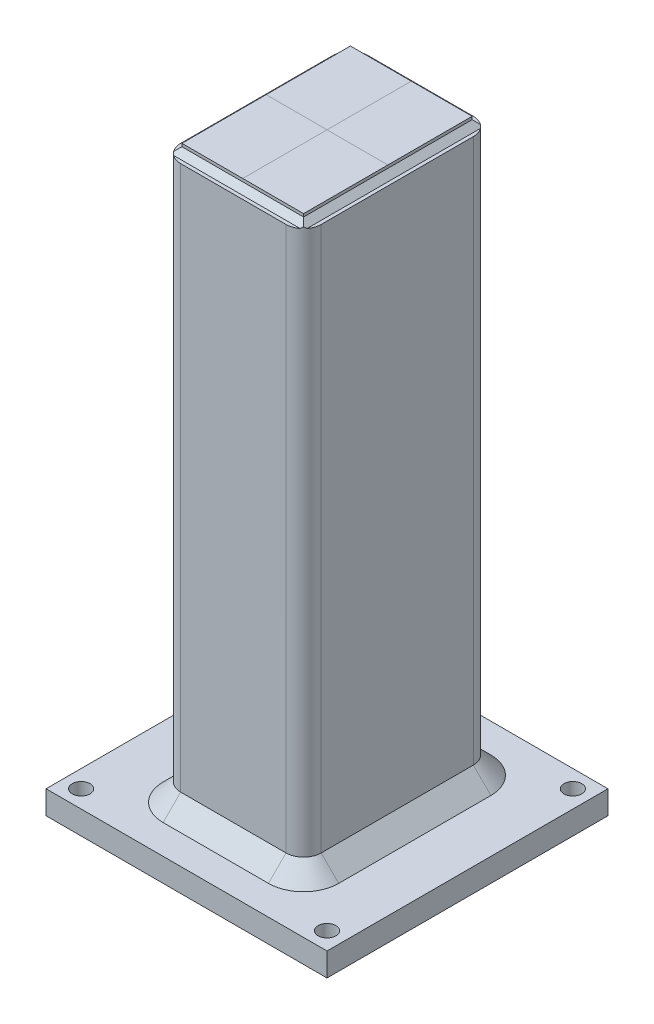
ISO-10303-21;
HEADER;
FILE_DESCRIPTION(('STEP AP214'),'2;1');
FILE_NAME('part.step','',(''),(''),'','','');
FILE_SCHEMA(('AUTOMOTIVE_DESIGN { 1 0 10303 214 1 1 1 1 }'));
ENDSEC;
DATA;
#1=APPLICATION_CONTEXT('core data for automotive mechanical design processes');
#2=APPLICATION_PROTOCOL_DEFINITION('international standard','automotive_design',2000,#1);
#3=PRODUCT_CONTEXT('',#1,'mechanical');
#4=PRODUCT('Part','Part','',(#3));
#5=PRODUCT_RELATED_PRODUCT_CATEGORY('part','',(#4));
#6=PRODUCT_DEFINITION_FORMATION('','',#4);
#7=PRODUCT_DEFINITION_CONTEXT('part definition',#1,'design');
#8=PRODUCT_DEFINITION('design','',#6,#7);
#9=PRODUCT_DEFINITION_SHAPE('','',#8);
#10=(LENGTH_UNIT() NAMED_UNIT(*) SI_UNIT(.MILLI.,.METRE.));
#11=(NAMED_UNIT(*) PLANE_ANGLE_UNIT() SI_UNIT($,.RADIAN.));
#12=(NAMED_UNIT(*) SI_UNIT($,.STERADIAN.) SOLID_ANGLE_UNIT());
#13=UNCERTAINTY_MEASURE_WITH_UNIT(LENGTH_MEASURE(1.E-05),#10,'distance_accuracy_value','');
#14=(GEOMETRIC_REPRESENTATION_CONTEXT(3) GLOBAL_UNCERTAINTY_ASSIGNED_CONTEXT((#13)) GLOBAL_UNIT_ASSIGNED_CONTEXT((#10,
#11,#12)) REPRESENTATION_CONTEXT('',''));
#15=CARTESIAN_POINT('',(0.,0.,0.));
#16=DIRECTION('',(0.,0.,1.));
#17=DIRECTION('',(1.,0.,0.));
#18=AXIS2_PLACEMENT_3D('',#15,#16,#17);
#19=CARTESIAN_POINT('',(0.,309.5625,0.));
#20=DIRECTION('',(0.,1.,0.));
#21=DIRECTION('',(0.,0.,1.));
#22=AXIS2_PLACEMENT_3D('',#19,#20,#21);
#23=PLANE('',#22);
#24=DIRECTION('',(1.,0.,0.));
#25=VECTOR('',#24,1.);
#26=CARTESIAN_POINT('',(-33.02,309.5625,45.72));
#27=LINE('',#26,#25);
#28=CARTESIAN_POINT('',(-33.02,309.5625,45.72));
#29=VERTEX_POINT('',#28);
#30=CARTESIAN_POINT('',(0.,309.5625,45.72));
#31=VERTEX_POINT('',#30);
#32=EDGE_CURVE('E389',#29,#31,#27,.T.);
#33=ORIENTED_EDGE('',*,*,#32,.T.);
#34=DIRECTION('',(0.,0.,-1.));
#35=VECTOR('',#34,1.);
#36=CARTESIAN_POINT('',(0.,309.5625,0.));
#37=LINE('',#36,#35);
#38=CARTESIAN_POINT('',(0.,309.5625,0.));
#39=VERTEX_POINT('',#38);
#40=EDGE_CURVE('E12',#31,#39,#37,.T.);
#41=ORIENTED_EDGE('',*,*,#40,.T.);
#42=DIRECTION('',(-1.,0.,0.));
#43=VECTOR('',#42,1.);
#44=CARTESIAN_POINT('',(0.,309.5625,0.));
#45=LINE('',#44,#43);
#46=CARTESIAN_POINT('',(-33.02,309.5625,0.));
#47=VERTEX_POINT('',#46);
#48=EDGE_CURVE('E626',#39,#47,#45,.T.);
#49=ORIENTED_EDGE('',*,*,#48,.T.);
#50=DIRECTION('',(0.,0.,1.));
#51=VECTOR('',#50,1.);
#52=CARTESIAN_POINT('',(-33.02,309.5625,-45.72));
#53=LINE('',#52,#51);
#54=EDGE_CURVE('E384',#47,#29,#53,.T.);
#55=ORIENTED_EDGE('',*,*,#54,.T.);
#56=EDGE_LOOP('',(#33,#41,#49,#55));
#57=FACE_BOUND('',#56,.T.);
#58=ADVANCED_FACE('F46',(#57),#23,.T.);
#59=ORIENTED_EDGE('',*,*,#48,.F.);
#60=DIRECTION('',(0.,0.,-1.));
#61=VECTOR('',#60,1.);
#62=CARTESIAN_POINT('',(0.,309.5625,0.));
#63=LINE('',#62,#61);
#64=CARTESIAN_POINT('',(0.,309.5625,-45.72));
#65=VERTEX_POINT('',#64);
#66=EDGE_CURVE('E51',#39,#65,#63,.T.);
#67=ORIENTED_EDGE('',*,*,#66,.T.);
#68=DIRECTION('',(-1.,0.,0.));
#69=VECTOR('',#68,1.);
#70=CARTESIAN_POINT('',(-33.02,309.5625,-45.72));
#71=LINE('',#70,#69);
#72=CARTESIAN_POINT('',(-33.02,309.5625,-45.72));
#73=VERTEX_POINT('',#72);
#74=EDGE_CURVE('E380',#65,#73,#71,.T.);
#75=ORIENTED_EDGE('',*,*,#74,.T.);
#76=EDGE_CURVE('E385',#73,#47,#53,.T.);
#77=ORIENTED_EDGE('',*,*,#76,.T.);
#78=EDGE_LOOP('',(#59,#67,#75,#77));
#79=FACE_BOUND('',#78,.T.);
#80=ADVANCED_FACE('F653',(#79),#23,.T.);
#81=ORIENTED_EDGE('',*,*,#40,.F.);
#82=CARTESIAN_POINT('',(33.02,309.5625,45.72));
#83=VERTEX_POINT('',#82);
#84=EDGE_CURVE('E388',#31,#83,#27,.T.);
#85=ORIENTED_EDGE('',*,*,#84,.T.);
#86=DIRECTION('',(0.,0.,-1.));
#87=VECTOR('',#86,1.);
#88=CARTESIAN_POINT('',(33.02,309.5625,-45.72));
#89=LINE('',#88,#87);
#90=CARTESIAN_POINT('',(33.02,309.5625,0.));
#91=VERTEX_POINT('',#90);
#92=EDGE_CURVE('E377',#83,#91,#89,.T.);
#93=ORIENTED_EDGE('',*,*,#92,.T.);
#94=EDGE_CURVE('E638',#91,#39,#45,.T.);
#95=ORIENTED_EDGE('',*,*,#94,.T.);
#96=EDGE_LOOP('',(#81,#85,#93,#95));
#97=FACE_BOUND('',#96,.T.);
#98=ADVANCED_FACE('F762',(#97),#23,.T.);
#99=CARTESIAN_POINT('',(-28.575,304.8,41.275));
#100=DIRECTION('',(0.,1.,0.));
#101=DIRECTION('',(0.,0.,1.));
#102=AXIS2_PLACEMENT_3D('',#99,#100,#101);
#103=PLANE('',#102);
#104=CARTESIAN_POINT('',(-28.575,304.8,-41.275));
#105=DIRECTION('',(0.,1.,0.));
#106=DIRECTION('',(0.,0.,1.));
#107=AXIS2_PLACEMENT_3D('',#104,#105,#106);
#108=CIRCLE('',#107,9.525);
#109=CARTESIAN_POINT('',(-28.575,304.8,-50.8));
#110=VERTEX_POINT('',#109);
#111=CARTESIAN_POINT('',(-34.2899999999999,304.8,-48.895));
#112=VERTEX_POINT('',#111);
#113=EDGE_CURVE('E471',#110,#112,#108,.T.);
#114=ORIENTED_EDGE('',*,*,#113,.T.);
#115=DIRECTION('',(1.,0.,0.));
#116=VECTOR('',#115,1.);
#117=CARTESIAN_POINT('',(-28.575,304.8,-48.895));
#118=LINE('',#117,#116);
#119=CARTESIAN_POINT('',(34.29,304.8,-48.895));
#120=VERTEX_POINT('',#119);
#121=EDGE_CURVE('E601',#112,#120,#118,.T.);
#122=ORIENTED_EDGE('',*,*,#121,.T.);
#123=CARTESIAN_POINT('',(28.575,304.8,-41.275));
#124=DIRECTION('',(0.,1.,0.));
#125=DIRECTION('',(0.,0.,-1.));
#126=AXIS2_PLACEMENT_3D('',#123,#124,#125);
#127=CIRCLE('',#126,9.525);
#128=CARTESIAN_POINT('',(28.575,304.8,-50.8));
#129=VERTEX_POINT('',#128);
#130=EDGE_CURVE('E464',#120,#129,#127,.T.);
#131=ORIENTED_EDGE('',*,*,#130,.T.);
#132=DIRECTION('',(-1.,0.,0.));
#133=VECTOR('',#132,1.);
#134=CARTESIAN_POINT('',(-28.575,304.8,-50.8));
#135=LINE('',#134,#133);
#136=EDGE_CURVE('E468',#129,#110,#135,.T.);
#137=ORIENTED_EDGE('',*,*,#136,.T.);
#138=EDGE_LOOP('',(#114,#122,#131,#137));
#139=FACE_BOUND('',#138,.T.);
#140=ADVANCED_FACE('F764',(#139),#103,.T.);
#141=CARTESIAN_POINT('',(-28.575,304.8,41.275));
#142=DIRECTION('',(0.,1.,0.));
#143=DIRECTION('',(0.,0.,1.));
#144=AXIS2_PLACEMENT_3D('',#141,#142,#143);
#145=CIRCLE('',#144,9.525);
#146=CARTESIAN_POINT('',(-38.1,304.8,41.275));
#147=VERTEX_POINT('',#146);
#148=CARTESIAN_POINT('',(-36.1950000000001,304.8,46.9899999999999));
#149=VERTEX_POINT('',#148);
#150=EDGE_CURVE('E453',#147,#149,#145,.T.);
#151=ORIENTED_EDGE('',*,*,#150,.T.);
#152=DIRECTION('',(0.,0.,-1.));
#153=VECTOR('',#152,1.);
#154=CARTESIAN_POINT('',(-36.1950000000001,304.8,41.275));
#155=LINE('',#154,#153);
#156=CARTESIAN_POINT('',(-36.1950000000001,304.8,-46.9899999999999));
#157=VERTEX_POINT('',#156);
#158=EDGE_CURVE('E599',#149,#157,#155,.T.);
#159=ORIENTED_EDGE('',*,*,#158,.T.);
#160=CARTESIAN_POINT('',(-38.1,304.8,-41.275));
#161=VERTEX_POINT('',#160);
#162=EDGE_CURVE('E470',#157,#161,#108,.T.);
#163=ORIENTED_EDGE('',*,*,#162,.T.);
#164=DIRECTION('',(0.,0.,1.));
#165=VECTOR('',#164,1.);
#166=CARTESIAN_POINT('',(-38.1,304.8,-41.275));
#167=LINE('',#166,#165);
#168=EDGE_CURVE('E474',#161,#147,#167,.T.);
#169=ORIENTED_EDGE('',*,*,#168,.T.);
#170=EDGE_LOOP('',(#151,#159,#163,#169));
#171=FACE_BOUND('',#170,.T.);
#172=ADVANCED_FACE('F682',(#171),#103,.T.);
#173=CARTESIAN_POINT('',(38.1,304.8,-41.275));
#174=VERTEX_POINT('',#173);
#175=CARTESIAN_POINT('',(36.1950000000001,304.8,-46.9899999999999));
#176=VERTEX_POINT('',#175);
#177=EDGE_CURVE('E465',#174,#176,#127,.T.);
#178=ORIENTED_EDGE('',*,*,#177,.T.);
#179=DIRECTION('',(0.,0.,1.));
#180=VECTOR('',#179,1.);
#181=CARTESIAN_POINT('',(36.1950000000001,304.8,41.275));
#182=LINE('',#181,#180);
#183=CARTESIAN_POINT('',(36.1950000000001,304.8,46.9899999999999));
#184=VERTEX_POINT('',#183);
#185=EDGE_CURVE('E597',#176,#184,#182,.T.);
#186=ORIENTED_EDGE('',*,*,#185,.T.);
#187=CARTESIAN_POINT('',(28.575,304.8,41.275));
#188=DIRECTION('',(0.,1.,0.));
#189=DIRECTION('',(0.,0.,1.));
#190=AXIS2_PLACEMENT_3D('',#187,#188,#189);
#191=CIRCLE('',#190,9.525);
#192=CARTESIAN_POINT('',(38.1,304.8,41.275));
#193=VERTEX_POINT('',#192);
#194=EDGE_CURVE('E458',#184,#193,#191,.T.);
#195=ORIENTED_EDGE('',*,*,#194,.T.);
#196=DIRECTION('',(0.,0.,-1.));
#197=VECTOR('',#196,1.);
#198=CARTESIAN_POINT('',(38.1,304.8,-41.275));
#199=LINE('',#198,#197);
#200=EDGE_CURVE('E462',#193,#174,#199,.T.);
#201=ORIENTED_EDGE('',*,*,#200,.T.);
#202=EDGE_LOOP('',(#178,#186,#195,#201));
#203=FACE_BOUND('',#202,.T.);
#204=ADVANCED_FACE('F748',(#203),#103,.T.);
#205=CARTESIAN_POINT('',(28.575,304.8,50.8));
#206=VERTEX_POINT('',#205);
#207=CARTESIAN_POINT('',(34.29,304.8,48.895));
#208=VERTEX_POINT('',#207);
#209=EDGE_CURVE('E459',#206,#208,#191,.T.);
#210=ORIENTED_EDGE('',*,*,#209,.T.);
#211=DIRECTION('',(-1.,0.,0.));
#212=VECTOR('',#211,1.);
#213=CARTESIAN_POINT('',(-28.575,304.8,48.895));
#214=LINE('',#213,#212);
#215=CARTESIAN_POINT('',(-34.2899999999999,304.8,48.895));
#216=VERTEX_POINT('',#215);
#217=EDGE_CURVE('E595',#208,#216,#214,.T.);
#218=ORIENTED_EDGE('',*,*,#217,.T.);
#219=CARTESIAN_POINT('',(-28.575,304.8,50.8));
#220=VERTEX_POINT('',#219);
#221=EDGE_CURVE('E452',#216,#220,#145,.T.);
#222=ORIENTED_EDGE('',*,*,#221,.T.);
#223=DIRECTION('',(1.,0.,0.));
#224=VECTOR('',#223,1.);
#225=CARTESIAN_POINT('',(-28.575,304.8,50.8));
#226=LINE('',#225,#224);
#227=EDGE_CURVE('E456',#220,#206,#226,.T.);
#228=ORIENTED_EDGE('',*,*,#227,.T.);
#229=EDGE_LOOP('',(#210,#218,#222,#228));
#230=FACE_BOUND('',#229,.T.);
#231=ADVANCED_FACE('F772',(#230),#103,.T.);
#232=CARTESIAN_POINT('',(0.,0.,0.));
#233=DIRECTION('',(0.,1.,0.));
#234=DIRECTION('',(0.,0.,1.));
#235=AXIS2_PLACEMENT_3D('',#232,#233,#234);
#236=PLANE('',#235);
#237=CARTESIAN_POINT('',(-66.675,0.,-66.675));
#238=DIRECTION('',(0.,1.,0.));
#239=DIRECTION('',(0.,0.,1.));
#240=AXIS2_PLACEMENT_3D('',#237,#238,#239);
#241=CIRCLE('',#240,4.826);
#242=CARTESIAN_POINT('',(-66.675,0.,-61.849));
#243=VERTEX_POINT('',#242);
#244=EDGE_CURVE('E1282',#243,#243,#241,.T.);
#245=ORIENTED_EDGE('',*,*,#244,.F.);
#246=EDGE_LOOP('',(#245));
#247=FACE_BOUND('',#246,.T.);
#248=CARTESIAN_POINT('',(-66.675,0.,66.675));
#249=DIRECTION('',(0.,1.,0.));
#250=DIRECTION('',(0.,0.,1.));
#251=AXIS2_PLACEMENT_3D('',#248,#249,#250);
#252=CIRCLE('',#251,4.826);
#253=CARTESIAN_POINT('',(-66.675,0.,71.501));
#254=VERTEX_POINT('',#253);
#255=EDGE_CURVE('E1286',#254,#254,#252,.T.);
#256=ORIENTED_EDGE('',*,*,#255,.F.);
#257=EDGE_LOOP('',(#256));
#258=FACE_BOUND('',#257,.T.);
#259=CARTESIAN_POINT('',(66.675,0.,66.675));
#260=DIRECTION('',(0.,1.,0.));
#261=DIRECTION('',(0.,0.,1.));
#262=AXIS2_PLACEMENT_3D('',#259,#260,#261);
#263=CIRCLE('',#262,4.82599999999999);
#264=CARTESIAN_POINT('',(66.675,0.,71.501));
#265=VERTEX_POINT('',#264);
#266=EDGE_CURVE('E1290',#265,#265,#263,.T.);
#267=ORIENTED_EDGE('',*,*,#266,.F.);
#268=EDGE_LOOP('',(#267));
#269=FACE_BOUND('',#268,.T.);
#270=CARTESIAN_POINT('',(66.675,0.,-66.675));
#271=DIRECTION('',(0.,1.,0.));
#272=DIRECTION('',(0.,0.,1.));
#273=AXIS2_PLACEMENT_3D('',#270,#271,#272);
#274=CIRCLE('',#273,4.82599999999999);
#275=CARTESIAN_POINT('',(66.675,0.,-61.849));
#276=VERTEX_POINT('',#275);
#277=EDGE_CURVE('E1293',#276,#276,#274,.T.);
#278=ORIENTED_EDGE('',*,*,#277,.F.);
#279=EDGE_LOOP('',(#278));
#280=FACE_BOUND('',#279,.T.);
#281=CARTESIAN_POINT('',(-28.575,0.,41.275));
#282=DIRECTION('',(0.,1.,0.));
#283=DIRECTION('',(0.,0.,1.));
#284=AXIS2_PLACEMENT_3D('',#281,#282,#283);
#285=CIRCLE('',#284,19.0499999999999);
#286=CARTESIAN_POINT('',(-28.575,0.,60.3249999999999));
#287=VERTEX_POINT('',#286);
#288=CARTESIAN_POINT('',(-47.6249999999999,0.,41.275));
#289=VERTEX_POINT('',#288);
#290=EDGE_CURVE('E549',#287,#289,#285,.F.);
#291=ORIENTED_EDGE('',*,*,#290,.T.);
#292=DIRECTION('',(0.,0.,-1.));
#293=VECTOR('',#292,1.);
#294=CARTESIAN_POINT('',(-47.6249999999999,0.,0.));
#295=LINE('',#294,#293);
#296=CARTESIAN_POINT('',(-47.6249999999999,0.,-41.275));
#297=VERTEX_POINT('',#296);
#298=EDGE_CURVE('E551',#289,#297,#295,.T.);
#299=ORIENTED_EDGE('',*,*,#298,.T.);
#300=CARTESIAN_POINT('',(-28.575,0.,-41.275));
#301=DIRECTION('',(0.,1.,0.));
#302=DIRECTION('',(0.,0.,1.));
#303=AXIS2_PLACEMENT_3D('',#300,#301,#302);
#304=CIRCLE('',#303,19.0499999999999);
#305=CARTESIAN_POINT('',(-28.575,0.,-60.3249999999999));
#306=VERTEX_POINT('',#305);
#307=EDGE_CURVE('E547',#297,#306,#304,.F.);
#308=ORIENTED_EDGE('',*,*,#307,.T.);
#309=DIRECTION('',(1.,0.,0.));
#310=VECTOR('',#309,1.);
#311=CARTESIAN_POINT('',(0.,0.,-60.3249999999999));
#312=LINE('',#311,#310);
#313=CARTESIAN_POINT('',(28.575,0.,-60.3249999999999));
#314=VERTEX_POINT('',#313);
#315=EDGE_CURVE('E543',#306,#314,#312,.T.);
#316=ORIENTED_EDGE('',*,*,#315,.T.);
#317=CARTESIAN_POINT('',(28.575,0.,-41.275));
#318=DIRECTION('',(0.,1.,0.));
#319=DIRECTION('',(0.,0.,1.));
#320=AXIS2_PLACEMENT_3D('',#317,#318,#319);
#321=CIRCLE('',#320,19.0499999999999);
#322=CARTESIAN_POINT('',(47.625,0.,-41.275));
#323=VERTEX_POINT('',#322);
#324=EDGE_CURVE('E539',#314,#323,#321,.F.);
#325=ORIENTED_EDGE('',*,*,#324,.T.);
#326=DIRECTION('',(0.,0.,1.));
#327=VECTOR('',#326,1.);
#328=CARTESIAN_POINT('',(47.625,0.,0.));
#329=LINE('',#328,#327);
#330=CARTESIAN_POINT('',(47.625,0.,41.275));
#331=VERTEX_POINT('',#330);
#332=EDGE_CURVE('E537',#323,#331,#329,.T.);
#333=ORIENTED_EDGE('',*,*,#332,.T.);
#334=CARTESIAN_POINT('',(28.575,0.,41.275));
#335=DIRECTION('',(0.,1.,0.));
#336=DIRECTION('',(0.,0.,1.));
#337=AXIS2_PLACEMENT_3D('',#334,#335,#336);
#338=CIRCLE('',#337,19.0499999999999);
#339=CARTESIAN_POINT('',(28.575,0.,60.3249999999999));
#340=VERTEX_POINT('',#339);
#341=EDGE_CURVE('E541',#331,#340,#338,.F.);
#342=ORIENTED_EDGE('',*,*,#341,.T.);
#343=DIRECTION('',(-1.,0.,0.));
#344=VECTOR('',#343,1.);
#345=CARTESIAN_POINT('',(0.,0.,60.3249999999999));
#346=LINE('',#345,#344);
#347=EDGE_CURVE('E545',#340,#287,#346,.T.);
#348=ORIENTED_EDGE('',*,*,#347,.T.);
#349=EDGE_LOOP('',(#291,#299,#308,#316,#325,#333,#342,#348));
#350=FACE_BOUND('',#349,.T.);
#351=DIRECTION('',(0.,0.,-1.));
#352=VECTOR('',#351,1.);
#353=CARTESIAN_POINT('',(76.2,0.,-76.2));
#354=LINE('',#353,#352);
#355=CARTESIAN_POINT('',(76.2,0.,76.2));
#356=VERTEX_POINT('',#355);
#357=CARTESIAN_POINT('',(76.2,0.,-76.2));
#358=VERTEX_POINT('',#357);
#359=EDGE_CURVE('E500',#356,#358,#354,.T.);
#360=ORIENTED_EDGE('',*,*,#359,.T.);
#361=DIRECTION('',(-1.,0.,0.));
#362=VECTOR('',#361,1.);
#363=CARTESIAN_POINT('',(-76.2,0.,-76.2));
#364=LINE('',#363,#362);
#365=CARTESIAN_POINT('',(-76.2,0.,-76.2));
#366=VERTEX_POINT('',#365);
#367=EDGE_CURVE('E517',#358,#366,#364,.T.);
#368=ORIENTED_EDGE('',*,*,#367,.T.);
#369=DIRECTION('',(0.,0.,1.));
#370=VECTOR('',#369,1.);
#371=CARTESIAN_POINT('',(-76.2,0.,-76.2));
#372=LINE('',#371,#370);
#373=CARTESIAN_POINT('',(-76.2,0.,76.2));
#374=VERTEX_POINT('',#373);
#375=EDGE_CURVE('E520',#366,#374,#372,.T.);
#376=ORIENTED_EDGE('',*,*,#375,.T.);
#377=DIRECTION('',(1.,0.,0.));
#378=VECTOR('',#377,1.);
#379=CARTESIAN_POINT('',(-76.2,0.,76.2));
#380=LINE('',#379,#378);
#381=EDGE_CURVE('E505',#374,#356,#380,.T.);
#382=ORIENTED_EDGE('',*,*,#381,.T.);
#383=EDGE_LOOP('',(#360,#368,#376,#382));
#384=FACE_BOUND('',#383,.T.);
#385=ADVANCED_FACE('F708',(#247,#258,#269,#280,#350,#384),#236,.T.);
#386=CARTESIAN_POINT('',(76.2,-12.7,-76.2));
#387=DIRECTION('',(1.,0.,0.));
#388=DIRECTION('',(0.,0.,-1.));
#389=AXIS2_PLACEMENT_3D('',#386,#387,#388);
#390=PLANE('',#389);
#391=ORIENTED_EDGE('',*,*,#359,.F.);
#392=DIRECTION('',(0.,1.,0.));
#393=VECTOR('',#392,1.);
#394=CARTESIAN_POINT('',(76.2,-12.7,76.2));
#395=LINE('',#394,#393);
#396=CARTESIAN_POINT('',(76.2,-12.7,76.2));
#397=VERTEX_POINT('',#396);
#398=EDGE_CURVE('E525',#397,#356,#395,.T.);
#399=ORIENTED_EDGE('',*,*,#398,.F.);
#400=DIRECTION('',(0.,0.,-1.));
#401=VECTOR('',#400,1.);
#402=CARTESIAN_POINT('',(76.2,-12.7,-76.2));
#403=LINE('',#402,#401);
#404=CARTESIAN_POINT('',(76.2,-12.7,-76.2));
#405=VERTEX_POINT('',#404);
#406=EDGE_CURVE('E501',#397,#405,#403,.T.);
#407=ORIENTED_EDGE('',*,*,#406,.T.);
#408=DIRECTION('',(0.,1.,0.));
#409=VECTOR('',#408,1.);
#410=CARTESIAN_POINT('',(76.2,-12.7,-76.2));
#411=LINE('',#410,#409);
#412=EDGE_CURVE('E514',#405,#358,#411,.T.);
#413=ORIENTED_EDGE('',*,*,#412,.T.);
#414=EDGE_LOOP('',(#391,#399,#407,#413));
#415=FACE_BOUND('',#414,.T.);
#416=ADVANCED_FACE('F1221',(#415),#390,.T.);
#417=CARTESIAN_POINT('',(-76.2,-12.7,76.2));
#418=DIRECTION('',(0.,0.,1.));
#419=DIRECTION('',(1.,0.,0.));
#420=AXIS2_PLACEMENT_3D('',#417,#418,#419);
#421=PLANE('',#420);
#422=ORIENTED_EDGE('',*,*,#381,.F.);
#423=DIRECTION('',(0.,1.,0.));
#424=VECTOR('',#423,1.);
#425=CARTESIAN_POINT('',(-76.2,-12.7,76.2));
#426=LINE('',#425,#424);
#427=CARTESIAN_POINT('',(-76.2,-12.7,76.2));
#428=VERTEX_POINT('',#427);
#429=EDGE_CURVE('E528',#428,#374,#426,.T.);
#430=ORIENTED_EDGE('',*,*,#429,.F.);
#431=DIRECTION('',(1.,0.,0.));
#432=VECTOR('',#431,1.);
#433=CARTESIAN_POINT('',(-76.2,-12.7,76.2));
#434=LINE('',#433,#432);
#435=EDGE_CURVE('E511',#428,#397,#434,.T.);
#436=ORIENTED_EDGE('',*,*,#435,.T.);
#437=ORIENTED_EDGE('',*,*,#398,.T.);
#438=EDGE_LOOP('',(#422,#430,#436,#437));
#439=FACE_BOUND('',#438,.T.);
#440=ADVANCED_FACE('F1217',(#439),#421,.T.);
#441=CARTESIAN_POINT('',(-76.2,-12.7,-76.2));
#442=DIRECTION('',(-1.,0.,0.));
#443=DIRECTION('',(0.,0.,1.));
#444=AXIS2_PLACEMENT_3D('',#441,#442,#443);
#445=PLANE('',#444);
#446=ORIENTED_EDGE('',*,*,#375,.F.);
#447=DIRECTION('',(0.,1.,0.));
#448=VECTOR('',#447,1.);
#449=CARTESIAN_POINT('',(-76.2,-12.7,-76.2));
#450=LINE('',#449,#448);
#451=CARTESIAN_POINT('',(-76.2,-12.7,-76.2));
#452=VERTEX_POINT('',#451);
#453=EDGE_CURVE('E530',#452,#366,#450,.T.);
#454=ORIENTED_EDGE('',*,*,#453,.F.);
#455=DIRECTION('',(0.,0.,1.));
#456=VECTOR('',#455,1.);
#457=CARTESIAN_POINT('',(-76.2,-12.7,-76.2));
#458=LINE('',#457,#456);
#459=EDGE_CURVE('E508',#452,#428,#458,.T.);
#460=ORIENTED_EDGE('',*,*,#459,.T.);
#461=ORIENTED_EDGE('',*,*,#429,.T.);
#462=EDGE_LOOP('',(#446,#454,#460,#461));
#463=FACE_BOUND('',#462,.T.);
#464=ADVANCED_FACE('F1220',(#463),#445,.T.);
#465=CARTESIAN_POINT('',(-76.2,-12.7,-76.2));
#466=DIRECTION('',(0.,0.,-1.));
#467=DIRECTION('',(-1.,0.,0.));
#468=AXIS2_PLACEMENT_3D('',#465,#466,#467);
#469=PLANE('',#468);
#470=ORIENTED_EDGE('',*,*,#367,.F.);
#471=ORIENTED_EDGE('',*,*,#412,.F.);
#472=DIRECTION('',(-1.,0.,0.));
#473=VECTOR('',#472,1.);
#474=CARTESIAN_POINT('',(-76.2,-12.7,-76.2));
#475=LINE('',#474,#473);
#476=EDGE_CURVE('E504',#405,#452,#475,.T.);
#477=ORIENTED_EDGE('',*,*,#476,.T.);
#478=ORIENTED_EDGE('',*,*,#453,.T.);
#479=EDGE_LOOP('',(#470,#471,#477,#478));
#480=FACE_BOUND('',#479,.T.);
#481=ADVANCED_FACE('F1214',(#480),#469,.T.);
#482=CARTESIAN_POINT('',(0.,-12.7,0.));
#483=DIRECTION('',(0.,1.,0.));
#484=DIRECTION('',(0.,0.,1.));
#485=AXIS2_PLACEMENT_3D('',#482,#483,#484);
#486=PLANE('',#485);
#487=CARTESIAN_POINT('',(-66.675,-12.7,-66.675));
#488=DIRECTION('',(0.,1.,0.));
#489=DIRECTION('',(0.,0.,1.));
#490=AXIS2_PLACEMENT_3D('',#487,#488,#489);
#491=CIRCLE('',#490,4.826);
#492=CARTESIAN_POINT('',(-66.675,-12.7,-61.849));
#493=VERTEX_POINT('',#492);
#494=EDGE_CURVE('E1355',#493,#493,#491,.T.);
#495=ORIENTED_EDGE('',*,*,#494,.T.);
#496=EDGE_LOOP('',(#495));
#497=FACE_BOUND('',#496,.T.);
#498=CARTESIAN_POINT('',(-66.675,-12.7,66.675));
#499=DIRECTION('',(0.,1.,0.));
#500=DIRECTION('',(0.,0.,1.));
#501=AXIS2_PLACEMENT_3D('',#498,#499,#500);
#502=CIRCLE('',#501,4.826);
#503=CARTESIAN_POINT('',(-66.675,-12.7,71.501));
#504=VERTEX_POINT('',#503);
#505=EDGE_CURVE('E1360',#504,#504,#502,.T.);
#506=ORIENTED_EDGE('',*,*,#505,.T.);
#507=EDGE_LOOP('',(#506));
#508=FACE_BOUND('',#507,.T.);
#509=CARTESIAN_POINT('',(66.675,-12.7,66.675));
#510=DIRECTION('',(0.,1.,0.));
#511=DIRECTION('',(0.,0.,1.));
#512=AXIS2_PLACEMENT_3D('',#509,#510,#511);
#513=CIRCLE('',#512,4.82599999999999);
#514=CARTESIAN_POINT('',(66.675,-12.7,71.501));
#515=VERTEX_POINT('',#514);
#516=EDGE_CURVE('E1295',#515,#515,#513,.T.);
#517=ORIENTED_EDGE('',*,*,#516,.T.);
#518=EDGE_LOOP('',(#517));
#519=FACE_BOUND('',#518,.T.);
#520=CARTESIAN_POINT('',(66.675,-12.7,-66.675));
#521=DIRECTION('',(0.,1.,0.));
#522=DIRECTION('',(0.,0.,1.));
#523=AXIS2_PLACEMENT_3D('',#520,#521,#522);
#524=CIRCLE('',#523,4.82599999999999);
#525=CARTESIAN_POINT('',(66.675,-12.7,-61.849));
#526=VERTEX_POINT('',#525);
#527=EDGE_CURVE('E630',#526,#526,#524,.T.);
#528=ORIENTED_EDGE('',*,*,#527,.T.);
#529=EDGE_LOOP('',(#528));
#530=FACE_BOUND('',#529,.T.);
#531=ORIENTED_EDGE('',*,*,#406,.F.);
#532=ORIENTED_EDGE('',*,*,#435,.F.);
#533=ORIENTED_EDGE('',*,*,#459,.F.);
#534=ORIENTED_EDGE('',*,*,#476,.F.);
#535=EDGE_LOOP('',(#531,#532,#533,#534));
#536=FACE_BOUND('',#535,.T.);
#537=ADVANCED_FACE('F1157',(#497,#508,#519,#530,#536),#486,.F.);
#538=CARTESIAN_POINT('',(-28.575,304.8,41.275));
#539=DIRECTION('',(0.,-1.,0.));
#540=DIRECTION('',(0.,0.,-1.));
#541=AXIS2_PLACEMENT_3D('',#538,#539,#540);
#542=CYLINDRICAL_SURFACE('',#541,9.525);
#543=DIRECTION('',(0.,-1.,0.));
#544=VECTOR('',#543,1.);
#545=CARTESIAN_POINT('',(-38.1,304.8,41.275));
#546=LINE('',#545,#544);
#547=CARTESIAN_POINT('',(-38.1,9.52500000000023,41.275));
#548=VERTEX_POINT('',#547);
#549=EDGE_CURVE('E476',#147,#548,#546,.T.);
#550=ORIENTED_EDGE('',*,*,#549,.T.);
#551=CARTESIAN_POINT('',(-28.575,9.52500000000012,41.275));
#552=DIRECTION('',(0.,1.,0.));
#553=DIRECTION('',(0.,0.,1.));
#554=AXIS2_PLACEMENT_3D('',#551,#552,#553);
#555=CIRCLE('',#554,9.525);
#556=CARTESIAN_POINT('',(-28.575,9.52500000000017,50.8));
#557=VERTEX_POINT('',#556);
#558=EDGE_CURVE('E554',#548,#557,#555,.T.);
#559=ORIENTED_EDGE('',*,*,#558,.T.);
#560=DIRECTION('',(0.,-1.,0.));
#561=VECTOR('',#560,1.);
#562=CARTESIAN_POINT('',(-28.575,304.8,50.8));
#563=LINE('',#562,#561);
#564=EDGE_CURVE('E497',#220,#557,#563,.T.);
#565=ORIENTED_EDGE('',*,*,#564,.F.);
#566=ORIENTED_EDGE('',*,*,#221,.F.);
#567=CARTESIAN_POINT('',(-28.575,312.42,41.275));
#568=DIRECTION('',(0.,-0.707106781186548,-0.707106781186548));
#569=DIRECTION('',(0.,-0.707106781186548,0.707106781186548));
#570=AXIS2_PLACEMENT_3D('',#567,#568,#569);
#571=ELLIPSE('',#570,13.4703841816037,9.525);
#572=CARTESIAN_POINT('',(-35.3101920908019,305.684807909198,48.0101920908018));
#573=VERTEX_POINT('',#572);
#574=EDGE_CURVE('E624',#216,#573,#571,.T.);
#575=ORIENTED_EDGE('',*,*,#574,.T.);
#576=CARTESIAN_POINT('',(-28.575,312.42,41.275));
#577=DIRECTION('',(0.707106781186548,-0.707106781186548,0.));
#578=DIRECTION('',(-0.707106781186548,-0.707106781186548,0.));
#579=AXIS2_PLACEMENT_3D('',#576,#577,#578);
#580=ELLIPSE('',#579,13.4703841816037,9.525);
#581=EDGE_CURVE('E614',#573,#149,#580,.T.);
#582=ORIENTED_EDGE('',*,*,#581,.T.);
#583=ORIENTED_EDGE('',*,*,#150,.F.);
#584=EDGE_LOOP('',(#550,#559,#565,#566,#575,#582,#583));
#585=FACE_BOUND('',#584,.T.);
#586=ADVANCED_FACE('F679',(#585),#542,.T.);
#587=CARTESIAN_POINT('',(-28.575,304.8,50.8));
#588=DIRECTION('',(0.,0.,-1.));
#589=DIRECTION('',(-1.,0.,0.));
#590=AXIS2_PLACEMENT_3D('',#587,#588,#589);
#591=PLANE('',#590);
#592=ORIENTED_EDGE('',*,*,#564,.T.);
#593=DIRECTION('',(1.,0.,0.));
#594=VECTOR('',#593,1.);
#595=CARTESIAN_POINT('',(-28.575,9.52500000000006,50.8));
#596=LINE('',#595,#594);
#597=CARTESIAN_POINT('',(28.575,9.52500000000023,50.8));
#598=VERTEX_POINT('',#597);
#599=EDGE_CURVE('E558',#557,#598,#596,.T.);
#600=ORIENTED_EDGE('',*,*,#599,.T.);
#601=DIRECTION('',(0.,-1.,0.));
#602=VECTOR('',#601,1.);
#603=CARTESIAN_POINT('',(28.575,304.8,50.8));
#604=LINE('',#603,#602);
#605=EDGE_CURVE('E494',#206,#598,#604,.T.);
#606=ORIENTED_EDGE('',*,*,#605,.F.);
#607=ORIENTED_EDGE('',*,*,#227,.F.);
#608=EDGE_LOOP('',(#592,#600,#606,#607));
#609=FACE_BOUND('',#608,.T.);
#610=ADVANCED_FACE('F697',(#609),#591,.F.);
#611=CARTESIAN_POINT('',(28.575,304.8,41.275));
#612=DIRECTION('',(0.,-1.,0.));
#613=DIRECTION('',(0.,0.,-1.));
#614=AXIS2_PLACEMENT_3D('',#611,#612,#613);
#615=CYLINDRICAL_SURFACE('',#614,9.525);
#616=ORIENTED_EDGE('',*,*,#605,.T.);
#617=CARTESIAN_POINT('',(28.575,9.52500000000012,41.275));
#618=DIRECTION('',(0.,1.,0.));
#619=DIRECTION('',(0.,0.,1.));
#620=AXIS2_PLACEMENT_3D('',#617,#618,#619);
#621=CIRCLE('',#620,9.525);
#622=CARTESIAN_POINT('',(38.1,9.52500000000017,41.275));
#623=VERTEX_POINT('',#622);
#624=EDGE_CURVE('E562',#598,#623,#621,.T.);
#625=ORIENTED_EDGE('',*,*,#624,.T.);
#626=DIRECTION('',(0.,-1.,0.));
#627=VECTOR('',#626,1.);
#628=CARTESIAN_POINT('',(38.1,304.8,41.275));
#629=LINE('',#628,#627);
#630=EDGE_CURVE('E491',#193,#623,#629,.T.);
#631=ORIENTED_EDGE('',*,*,#630,.F.);
#632=ORIENTED_EDGE('',*,*,#194,.F.);
#633=CARTESIAN_POINT('',(28.575,312.42,41.275));
#634=DIRECTION('',(-0.707106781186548,-0.707106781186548,0.));
#635=DIRECTION('',(0.707106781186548,-0.707106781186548,0.));
#636=AXIS2_PLACEMENT_3D('',#633,#634,#635);
#637=ELLIPSE('',#636,13.4703841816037,9.525);
#638=CARTESIAN_POINT('',(35.3101920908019,305.684807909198,48.0101920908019));
#639=VERTEX_POINT('',#638);
#640=EDGE_CURVE('E620',#184,#639,#637,.T.);
#641=ORIENTED_EDGE('',*,*,#640,.T.);
#642=CARTESIAN_POINT('',(28.575,312.42,41.275));
#643=DIRECTION('',(0.,-0.707106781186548,-0.707106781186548));
#644=DIRECTION('',(0.,-0.707106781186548,0.707106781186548));
#645=AXIS2_PLACEMENT_3D('',#642,#643,#644);
#646=ELLIPSE('',#645,13.4703841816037,9.525);
#647=EDGE_CURVE('E622',#639,#208,#646,.T.);
#648=ORIENTED_EDGE('',*,*,#647,.T.);
#649=ORIENTED_EDGE('',*,*,#209,.F.);
#650=EDGE_LOOP('',(#616,#625,#631,#632,#641,#648,#649));
#651=FACE_BOUND('',#650,.T.);
#652=ADVANCED_FACE('F739',(#651),#615,.T.);
#653=CARTESIAN_POINT('',(38.1,304.8,-41.275));
#654=DIRECTION('',(-1.,0.,0.));
#655=DIRECTION('',(0.,0.,1.));
#656=AXIS2_PLACEMENT_3D('',#653,#654,#655);
#657=PLANE('',#656);
#658=ORIENTED_EDGE('',*,*,#630,.T.);
#659=DIRECTION('',(0.,0.,-1.));
#660=VECTOR('',#659,1.);
#661=CARTESIAN_POINT('',(38.1,9.52500000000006,-41.275));
#662=LINE('',#661,#660);
#663=CARTESIAN_POINT('',(38.1,9.52500000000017,-41.275));
#664=VERTEX_POINT('',#663);
#665=EDGE_CURVE('E566',#623,#664,#662,.T.);
#666=ORIENTED_EDGE('',*,*,#665,.T.);
#667=DIRECTION('',(0.,-1.,0.));
#668=VECTOR('',#667,1.);
#669=CARTESIAN_POINT('',(38.1,304.8,-41.275));
#670=LINE('',#669,#668);
#671=EDGE_CURVE('E488',#174,#664,#670,.T.);
#672=ORIENTED_EDGE('',*,*,#671,.F.);
#673=ORIENTED_EDGE('',*,*,#200,.F.);
#674=EDGE_LOOP('',(#658,#666,#672,#673));
#675=FACE_BOUND('',#674,.T.);
#676=ADVANCED_FACE('F744',(#675),#657,.F.);
#677=CARTESIAN_POINT('',(28.575,304.8,-41.275));
#678=DIRECTION('',(0.,-1.,0.));
#679=DIRECTION('',(0.,0.,-1.));
#680=AXIS2_PLACEMENT_3D('',#677,#678,#679);
#681=CYLINDRICAL_SURFACE('',#680,9.525);
#682=ORIENTED_EDGE('',*,*,#671,.T.);
#683=CARTESIAN_POINT('',(28.575,9.52500000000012,-41.275));
#684=DIRECTION('',(0.,1.,0.));
#685=DIRECTION('',(0.,0.,1.));
#686=AXIS2_PLACEMENT_3D('',#683,#684,#685);
#687=CIRCLE('',#686,9.525);
#688=CARTESIAN_POINT('',(28.575,9.52500000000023,-50.8));
#689=VERTEX_POINT('',#688);
#690=EDGE_CURVE('E564',#664,#689,#687,.T.);
#691=ORIENTED_EDGE('',*,*,#690,.T.);
#692=DIRECTION('',(0.,-1.,0.));
#693=VECTOR('',#692,1.);
#694=CARTESIAN_POINT('',(28.575,304.8,-50.8));
#695=LINE('',#694,#693);
#696=EDGE_CURVE('E485',#129,#689,#695,.T.);
#697=ORIENTED_EDGE('',*,*,#696,.F.);
#698=ORIENTED_EDGE('',*,*,#130,.F.);
#699=CARTESIAN_POINT('',(28.575,312.42,-41.275));
#700=DIRECTION('',(0.,-0.707106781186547,0.707106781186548));
#701=DIRECTION('',(0.,-0.707106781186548,-0.707106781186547));
#702=AXIS2_PLACEMENT_3D('',#699,#700,#701);
#703=ELLIPSE('',#702,13.4703841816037,9.525);
#704=CARTESIAN_POINT('',(35.3101920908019,305.684807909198,-48.0101920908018));
#705=VERTEX_POINT('',#704);
#706=EDGE_CURVE('E612',#120,#705,#703,.T.);
#707=ORIENTED_EDGE('',*,*,#706,.T.);
#708=CARTESIAN_POINT('',(28.575,312.42,-41.275));
#709=DIRECTION('',(-0.707106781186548,-0.707106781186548,0.));
#710=DIRECTION('',(0.707106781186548,-0.707106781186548,0.));
#711=AXIS2_PLACEMENT_3D('',#708,#709,#710);
#712=ELLIPSE('',#711,13.4703841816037,9.525);
#713=EDGE_CURVE('E618',#705,#176,#712,.T.);
#714=ORIENTED_EDGE('',*,*,#713,.T.);
#715=ORIENTED_EDGE('',*,*,#177,.F.);
#716=EDGE_LOOP('',(#682,#691,#697,#698,#707,#714,#715));
#717=FACE_BOUND('',#716,.T.);
#718=ADVANCED_FACE('F1110',(#717),#681,.T.);
#719=CARTESIAN_POINT('',(-28.575,304.8,-50.8));
#720=DIRECTION('',(0.,0.,1.));
#721=DIRECTION('',(1.,0.,0.));
#722=AXIS2_PLACEMENT_3D('',#719,#720,#721);
#723=PLANE('',#722);
#724=ORIENTED_EDGE('',*,*,#696,.T.);
#725=DIRECTION('',(-1.,0.,0.));
#726=VECTOR('',#725,1.);
#727=CARTESIAN_POINT('',(-28.575,9.52500000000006,-50.8));
#728=LINE('',#727,#726);
#729=CARTESIAN_POINT('',(-28.575,9.52500000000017,-50.8));
#730=VERTEX_POINT('',#729);
#731=EDGE_CURVE('E560',#689,#730,#728,.T.);
#732=ORIENTED_EDGE('',*,*,#731,.T.);
#733=DIRECTION('',(0.,-1.,0.));
#734=VECTOR('',#733,1.);
#735=CARTESIAN_POINT('',(-28.575,304.8,-50.8));
#736=LINE('',#735,#734);
#737=EDGE_CURVE('E482',#110,#730,#736,.T.);
#738=ORIENTED_EDGE('',*,*,#737,.F.);
#739=ORIENTED_EDGE('',*,*,#136,.F.);
#740=EDGE_LOOP('',(#724,#732,#738,#739));
#741=FACE_BOUND('',#740,.T.);
#742=ADVANCED_FACE('F1117',(#741),#723,.F.);
#743=CARTESIAN_POINT('',(-28.575,304.8,-41.275));
#744=DIRECTION('',(0.,-1.,0.));
#745=DIRECTION('',(0.,0.,-1.));
#746=AXIS2_PLACEMENT_3D('',#743,#744,#745);
#747=CYLINDRICAL_SURFACE('',#746,9.525);
#748=ORIENTED_EDGE('',*,*,#737,.T.);
#749=CARTESIAN_POINT('',(-28.575,9.52500000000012,-41.275));
#750=DIRECTION('',(0.,1.,0.));
#751=DIRECTION('',(0.,0.,1.));
#752=AXIS2_PLACEMENT_3D('',#749,#750,#751);
#753=CIRCLE('',#752,9.525);
#754=CARTESIAN_POINT('',(-38.1,9.52500000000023,-41.275));
#755=VERTEX_POINT('',#754);
#756=EDGE_CURVE('E556',#730,#755,#753,.T.);
#757=ORIENTED_EDGE('',*,*,#756,.T.);
#758=DIRECTION('',(0.,-1.,0.));
#759=VECTOR('',#758,1.);
#760=CARTESIAN_POINT('',(-38.1,304.8,-41.275));
#761=LINE('',#760,#759);
#762=EDGE_CURVE('E479',#161,#755,#761,.T.);
#763=ORIENTED_EDGE('',*,*,#762,.F.);
#764=ORIENTED_EDGE('',*,*,#162,.F.);
#765=CARTESIAN_POINT('',(-28.575,312.42,-41.275));
#766=DIRECTION('',(0.707106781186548,-0.707106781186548,0.));
#767=DIRECTION('',(-0.707106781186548,-0.707106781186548,0.));
#768=AXIS2_PLACEMENT_3D('',#765,#766,#767);
#769=ELLIPSE('',#768,13.4703841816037,9.525);
#770=CARTESIAN_POINT('',(-35.3101920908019,305.684807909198,-48.0101920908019));
#771=VERTEX_POINT('',#770);
#772=EDGE_CURVE('E616',#157,#771,#769,.T.);
#773=ORIENTED_EDGE('',*,*,#772,.T.);
#774=CARTESIAN_POINT('',(-28.575,312.42,-41.275));
#775=DIRECTION('',(0.,-0.707106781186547,0.707106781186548));
#776=DIRECTION('',(0.,-0.707106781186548,-0.707106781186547));
#777=AXIS2_PLACEMENT_3D('',#774,#775,#776);
#778=ELLIPSE('',#777,13.4703841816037,9.525);
#779=EDGE_CURVE('E610',#771,#112,#778,.T.);
#780=ORIENTED_EDGE('',*,*,#779,.T.);
#781=ORIENTED_EDGE('',*,*,#113,.F.);
#782=EDGE_LOOP('',(#748,#757,#763,#764,#773,#780,#781));
#783=FACE_BOUND('',#782,.T.);
#784=ADVANCED_FACE('F1121',(#783),#747,.T.);
#785=CARTESIAN_POINT('',(-38.1,304.8,-41.275));
#786=DIRECTION('',(1.,0.,0.));
#787=DIRECTION('',(0.,0.,-1.));
#788=AXIS2_PLACEMENT_3D('',#785,#786,#787);
#789=PLANE('',#788);
#790=ORIENTED_EDGE('',*,*,#762,.T.);
#791=DIRECTION('',(0.,0.,1.));
#792=VECTOR('',#791,1.);
#793=CARTESIAN_POINT('',(-38.1,9.52500000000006,-41.275));
#794=LINE('',#793,#792);
#795=EDGE_CURVE('E534',#755,#548,#794,.T.);
#796=ORIENTED_EDGE('',*,*,#795,.T.);
#797=ORIENTED_EDGE('',*,*,#549,.F.);
#798=ORIENTED_EDGE('',*,*,#168,.F.);
#799=EDGE_LOOP('',(#790,#796,#797,#798));
#800=FACE_BOUND('',#799,.T.);
#801=ADVANCED_FACE('F688',(#800),#789,.F.);
#802=CARTESIAN_POINT('',(33.02,309.5625,-45.72));
#803=DIRECTION('',(-1.,0.,0.));
#804=DIRECTION('',(0.,0.,1.));
#805=AXIS2_PLACEMENT_3D('',#802,#803,#804);
#806=PLANE('',#805);
#807=DIRECTION('',(0.,-1.,0.));
#808=VECTOR('',#807,1.);
#809=CARTESIAN_POINT('',(33.02,309.5625,45.72));
#810=LINE('',#809,#808);
#811=CARTESIAN_POINT('',(33.02,307.975,45.72));
#812=VERTEX_POINT('',#811);
#813=EDGE_CURVE('E392',#83,#812,#810,.T.);
#814=ORIENTED_EDGE('',*,*,#813,.T.);
#815=DIRECTION('',(0.,0.,-1.));
#816=VECTOR('',#815,1.);
#817=CARTESIAN_POINT('',(33.02,307.975,-45.72));
#818=LINE('',#817,#816);
#819=CARTESIAN_POINT('',(33.02,307.975,-45.72));
#820=VERTEX_POINT('',#819);
#821=EDGE_CURVE('E606',#812,#820,#818,.T.);
#822=ORIENTED_EDGE('',*,*,#821,.T.);
#823=DIRECTION('',(0.,-1.,0.));
#824=VECTOR('',#823,1.);
#825=CARTESIAN_POINT('',(33.02,309.5625,-45.72));
#826=LINE('',#825,#824);
#827=CARTESIAN_POINT('',(33.02,309.5625,-45.72));
#828=VERTEX_POINT('',#827);
#829=EDGE_CURVE('E401',#828,#820,#826,.T.);
#830=ORIENTED_EDGE('',*,*,#829,.F.);
#831=EDGE_CURVE('E376',#91,#828,#89,.T.);
#832=ORIENTED_EDGE('',*,*,#831,.F.);
#833=ORIENTED_EDGE('',*,*,#92,.F.);
#834=EDGE_LOOP('',(#814,#822,#830,#832,#833));
#835=FACE_BOUND('',#834,.T.);
#836=ADVANCED_FACE('F757',(#835),#806,.F.);
#837=CARTESIAN_POINT('',(-33.02,309.5625,-45.72));
#838=DIRECTION('',(0.,0.,1.));
#839=DIRECTION('',(1.,0.,0.));
#840=AXIS2_PLACEMENT_3D('',#837,#838,#839);
#841=PLANE('',#840);
#842=ORIENTED_EDGE('',*,*,#829,.T.);
#843=DIRECTION('',(-1.,0.,0.));
#844=VECTOR('',#843,1.);
#845=CARTESIAN_POINT('',(-33.02,307.975,-45.72));
#846=LINE('',#845,#844);
#847=CARTESIAN_POINT('',(-33.02,307.975,-45.72));
#848=VERTEX_POINT('',#847);
#849=EDGE_CURVE('E568',#820,#848,#846,.T.);
#850=ORIENTED_EDGE('',*,*,#849,.T.);
#851=DIRECTION('',(0.,-1.,0.));
#852=VECTOR('',#851,1.);
#853=CARTESIAN_POINT('',(-33.02,309.5625,-45.72));
#854=LINE('',#853,#852);
#855=EDGE_CURVE('E398',#73,#848,#854,.T.);
#856=ORIENTED_EDGE('',*,*,#855,.F.);
#857=ORIENTED_EDGE('',*,*,#74,.F.);
#858=EDGE_CURVE('E381',#828,#65,#71,.T.);
#859=ORIENTED_EDGE('',*,*,#858,.F.);
#860=EDGE_LOOP('',(#842,#850,#856,#857,#859));
#861=FACE_BOUND('',#860,.T.);
#862=ADVANCED_FACE('F657',(#861),#841,.F.);
#863=CARTESIAN_POINT('',(-33.02,309.5625,-45.72));
#864=DIRECTION('',(1.,0.,0.));
#865=DIRECTION('',(0.,0.,-1.));
#866=AXIS2_PLACEMENT_3D('',#863,#864,#865);
#867=PLANE('',#866);
#868=ORIENTED_EDGE('',*,*,#855,.T.);
#869=DIRECTION('',(0.,0.,1.));
#870=VECTOR('',#869,1.);
#871=CARTESIAN_POINT('',(-33.02,307.975,-45.72));
#872=LINE('',#871,#870);
#873=CARTESIAN_POINT('',(-33.02,307.975,45.72));
#874=VERTEX_POINT('',#873);
#875=EDGE_CURVE('E604',#848,#874,#872,.T.);
#876=ORIENTED_EDGE('',*,*,#875,.T.);
#877=DIRECTION('',(0.,-1.,0.));
#878=VECTOR('',#877,1.);
#879=CARTESIAN_POINT('',(-33.02,309.5625,45.72));
#880=LINE('',#879,#878);
#881=EDGE_CURVE('E395',#29,#874,#880,.T.);
#882=ORIENTED_EDGE('',*,*,#881,.F.);
#883=ORIENTED_EDGE('',*,*,#54,.F.);
#884=ORIENTED_EDGE('',*,*,#76,.F.);
#885=EDGE_LOOP('',(#868,#876,#882,#883,#884));
#886=FACE_BOUND('',#885,.T.);
#887=ADVANCED_FACE('F651',(#886),#867,.F.);
#888=CARTESIAN_POINT('',(-33.02,309.5625,45.72));
#889=DIRECTION('',(0.,0.,-1.));
#890=DIRECTION('',(-1.,0.,0.));
#891=AXIS2_PLACEMENT_3D('',#888,#889,#890);
#892=PLANE('',#891);
#893=ORIENTED_EDGE('',*,*,#881,.T.);
#894=DIRECTION('',(1.,0.,0.));
#895=VECTOR('',#894,1.);
#896=CARTESIAN_POINT('',(-33.02,307.975,45.72));
#897=LINE('',#896,#895);
#898=EDGE_CURVE('E608',#874,#812,#897,.T.);
#899=ORIENTED_EDGE('',*,*,#898,.T.);
#900=ORIENTED_EDGE('',*,*,#813,.F.);
#901=ORIENTED_EDGE('',*,*,#84,.F.);
#902=ORIENTED_EDGE('',*,*,#32,.F.);
#903=EDGE_LOOP('',(#893,#899,#900,#901,#902));
#904=FACE_BOUND('',#903,.T.);
#905=ADVANCED_FACE('F664',(#904),#892,.F.);
#906=ORIENTED_EDGE('',*,*,#66,.F.);
#907=ORIENTED_EDGE('',*,*,#94,.F.);
#908=ORIENTED_EDGE('',*,*,#831,.T.);
#909=ORIENTED_EDGE('',*,*,#858,.T.);
#910=EDGE_LOOP('',(#906,#907,#908,#909));
#911=FACE_BOUND('',#910,.T.);
#912=ADVANCED_FACE('F761',(#911),#23,.T.);
#913=CARTESIAN_POINT('',(38.1,9.52500000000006,-41.275));
#914=DIRECTION('',(-0.707106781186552,-0.707106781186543,0.));
#915=DIRECTION('',(0.,0.,-1.));
#916=AXIS2_PLACEMENT_3D('',#913,#914,#915);
#917=PLANE('',#916);
#918=DIRECTION('',(-0.707106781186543,0.707106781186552,0.));
#919=VECTOR('',#918,1.);
#920=CARTESIAN_POINT('',(47.625,0.,41.275));
#921=LINE('',#920,#919);
#922=EDGE_CURVE('E586',#331,#623,#921,.T.);
#923=ORIENTED_EDGE('',*,*,#922,.F.);
#924=ORIENTED_EDGE('',*,*,#332,.F.);
#925=DIRECTION('',(0.707106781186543,-0.707106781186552,0.));
#926=VECTOR('',#925,1.);
#927=CARTESIAN_POINT('',(38.1,9.52500000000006,-41.275));
#928=LINE('',#927,#926);
#929=EDGE_CURVE('E589',#664,#323,#928,.T.);
#930=ORIENTED_EDGE('',*,*,#929,.F.);
#931=ORIENTED_EDGE('',*,*,#665,.F.);
#932=EDGE_LOOP('',(#923,#924,#930,#931));
#933=FACE_BOUND('',#932,.T.);
#934=ADVANCED_FACE('F731',(#933),#917,.F.);
#935=CARTESIAN_POINT('',(28.575,9.52500000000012,-41.275));
#936=DIRECTION('',(0.,-1.,0.));
#937=DIRECTION('',(0.,0.,-1.));
#938=AXIS2_PLACEMENT_3D('',#935,#936,#937);
#939=CONICAL_SURFACE('',#938,9.525,0.78539816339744);
#940=ORIENTED_EDGE('',*,*,#929,.T.);
#941=ORIENTED_EDGE('',*,*,#324,.F.);
#942=DIRECTION('',(0.,-0.707106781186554,-0.707106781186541));
#943=VECTOR('',#942,1.);
#944=CARTESIAN_POINT('',(28.575,9.52500000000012,-50.8));
#945=LINE('',#944,#943);
#946=EDGE_CURVE('E583',#689,#314,#945,.T.);
#947=ORIENTED_EDGE('',*,*,#946,.F.);
#948=ORIENTED_EDGE('',*,*,#690,.F.);
#949=EDGE_LOOP('',(#940,#941,#947,#948));
#950=FACE_BOUND('',#949,.T.);
#951=ADVANCED_FACE('F726',(#950),#939,.T.);
#952=CARTESIAN_POINT('',(28.575,9.52500000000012,41.275));
#953=DIRECTION('',(0.,-1.,0.));
#954=DIRECTION('',(0.,0.,-1.));
#955=AXIS2_PLACEMENT_3D('',#952,#953,#954);
#956=CONICAL_SURFACE('',#955,9.525,0.78539816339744);
#957=ORIENTED_EDGE('',*,*,#922,.T.);
#958=ORIENTED_EDGE('',*,*,#624,.F.);
#959=DIRECTION('',(0.,0.707106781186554,-0.707106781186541));
#960=VECTOR('',#959,1.);
#961=CARTESIAN_POINT('',(28.575,0.,60.3249999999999));
#962=LINE('',#961,#960);
#963=EDGE_CURVE('E580',#340,#598,#962,.T.);
#964=ORIENTED_EDGE('',*,*,#963,.F.);
#965=ORIENTED_EDGE('',*,*,#341,.F.);
#966=EDGE_LOOP('',(#957,#958,#964,#965));
#967=FACE_BOUND('',#966,.T.);
#968=ADVANCED_FACE('F736',(#967),#956,.T.);
#969=CARTESIAN_POINT('',(-28.575,9.52500000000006,-50.8));
#970=DIRECTION('',(0.,-0.707106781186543,0.707106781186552));
#971=DIRECTION('',(-1.,0.,0.));
#972=AXIS2_PLACEMENT_3D('',#969,#970,#971);
#973=PLANE('',#972);
#974=ORIENTED_EDGE('',*,*,#946,.T.);
#975=ORIENTED_EDGE('',*,*,#315,.F.);
#976=DIRECTION('',(0.,-0.707106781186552,-0.707106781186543));
#977=VECTOR('',#976,1.);
#978=CARTESIAN_POINT('',(-28.575,9.52500000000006,-50.8));
#979=LINE('',#978,#977);
#980=EDGE_CURVE('E577',#730,#306,#979,.T.);
#981=ORIENTED_EDGE('',*,*,#980,.F.);
#982=ORIENTED_EDGE('',*,*,#731,.F.);
#983=EDGE_LOOP('',(#974,#975,#981,#982));
#984=FACE_BOUND('',#983,.T.);
#985=ADVANCED_FACE('F721',(#984),#973,.F.);
#986=CARTESIAN_POINT('',(-28.575,9.52500000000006,50.8));
#987=DIRECTION('',(0.,-0.707106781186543,-0.707106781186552));
#988=DIRECTION('',(1.,0.,0.));
#989=AXIS2_PLACEMENT_3D('',#986,#987,#988);
#990=PLANE('',#989);
#991=ORIENTED_EDGE('',*,*,#963,.T.);
#992=ORIENTED_EDGE('',*,*,#599,.F.);
#993=DIRECTION('',(0.,0.707106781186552,-0.707106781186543));
#994=VECTOR('',#993,1.);
#995=CARTESIAN_POINT('',(-28.575,0.,60.3249999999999));
#996=LINE('',#995,#994);
#997=EDGE_CURVE('E574',#287,#557,#996,.T.);
#998=ORIENTED_EDGE('',*,*,#997,.F.);
#999=ORIENTED_EDGE('',*,*,#347,.F.);
#1000=EDGE_LOOP('',(#991,#992,#998,#999));
#1001=FACE_BOUND('',#1000,.T.);
#1002=ADVANCED_FACE('F701',(#1001),#990,.F.);
#1003=CARTESIAN_POINT('',(-28.575,9.52500000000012,-41.275));
#1004=DIRECTION('',(0.,-1.,0.));
#1005=DIRECTION('',(0.,0.,-1.));
#1006=AXIS2_PLACEMENT_3D('',#1003,#1004,#1005);
#1007=CONICAL_SURFACE('',#1006,9.525,0.78539816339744);
#1008=ORIENTED_EDGE('',*,*,#980,.T.);
#1009=ORIENTED_EDGE('',*,*,#307,.F.);
#1010=DIRECTION('',(-0.707106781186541,-0.707106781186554,0.));
#1011=VECTOR('',#1010,1.);
#1012=CARTESIAN_POINT('',(-38.1,9.52500000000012,-41.275));
#1013=LINE('',#1012,#1011);
#1014=EDGE_CURVE('E571',#755,#297,#1013,.T.);
#1015=ORIENTED_EDGE('',*,*,#1014,.F.);
#1016=ORIENTED_EDGE('',*,*,#756,.F.);
#1017=EDGE_LOOP('',(#1008,#1009,#1015,#1016));
#1018=FACE_BOUND('',#1017,.T.);
#1019=ADVANCED_FACE('F716',(#1018),#1007,.T.);
#1020=CARTESIAN_POINT('',(-28.575,9.52500000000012,41.275));
#1021=DIRECTION('',(0.,-1.,0.));
#1022=DIRECTION('',(0.,0.,-1.));
#1023=AXIS2_PLACEMENT_3D('',#1020,#1021,#1022);
#1024=CONICAL_SURFACE('',#1023,9.525,0.78539816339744);
#1025=ORIENTED_EDGE('',*,*,#997,.T.);
#1026=ORIENTED_EDGE('',*,*,#558,.F.);
#1027=DIRECTION('',(0.707106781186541,0.707106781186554,0.));
#1028=VECTOR('',#1027,1.);
#1029=CARTESIAN_POINT('',(-47.6249999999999,0.,41.275));
#1030=LINE('',#1029,#1028);
#1031=EDGE_CURVE('E569',#289,#548,#1030,.T.);
#1032=ORIENTED_EDGE('',*,*,#1031,.F.);
#1033=ORIENTED_EDGE('',*,*,#290,.F.);
#1034=EDGE_LOOP('',(#1025,#1026,#1032,#1033));
#1035=FACE_BOUND('',#1034,.T.);
#1036=ADVANCED_FACE('F705',(#1035),#1024,.T.);
#1037=CARTESIAN_POINT('',(-38.1,9.52500000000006,-41.275));
#1038=DIRECTION('',(0.707106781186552,-0.707106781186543,0.));
#1039=DIRECTION('',(0.,0.,1.));
#1040=AXIS2_PLACEMENT_3D('',#1037,#1038,#1039);
#1041=PLANE('',#1040);
#1042=ORIENTED_EDGE('',*,*,#1014,.T.);
#1043=ORIENTED_EDGE('',*,*,#298,.F.);
#1044=ORIENTED_EDGE('',*,*,#1031,.T.);
#1045=ORIENTED_EDGE('',*,*,#795,.F.);
#1046=EDGE_LOOP('',(#1042,#1043,#1044,#1045));
#1047=FACE_BOUND('',#1046,.T.);
#1048=ADVANCED_FACE('F711',(#1047),#1041,.F.);
#1049=CARTESIAN_POINT('',(-33.02,307.975,45.72));
#1050=DIRECTION('',(0.,-0.707106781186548,-0.707106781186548));
#1051=DIRECTION('',(1.,0.,0.));
#1052=AXIS2_PLACEMENT_3D('',#1049,#1050,#1051);
#1053=PLANE('',#1052);
#1054=ORIENTED_EDGE('',*,*,#217,.F.);
#1055=ORIENTED_EDGE('',*,*,#647,.F.);
#1056=DIRECTION('',(0.577350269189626,-0.577350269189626,0.577350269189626));
#1057=VECTOR('',#1056,1.);
#1058=CARTESIAN_POINT('',(2.54000000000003,338.455,15.24));
#1059=LINE('',#1058,#1057);
#1060=EDGE_CURVE('E572',#812,#639,#1059,.T.);
#1061=ORIENTED_EDGE('',*,*,#1060,.F.);
#1062=ORIENTED_EDGE('',*,*,#898,.F.);
#1063=DIRECTION('',(0.577350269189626,0.577350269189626,-0.577350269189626));
#1064=VECTOR('',#1063,1.);
#1065=CARTESIAN_POINT('',(-2.54000000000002,338.455,15.24));
#1066=LINE('',#1065,#1064);
#1067=EDGE_CURVE('E633',#573,#874,#1066,.T.);
#1068=ORIENTED_EDGE('',*,*,#1067,.F.);
#1069=ORIENTED_EDGE('',*,*,#574,.F.);
#1070=EDGE_LOOP('',(#1054,#1055,#1061,#1062,#1068,#1069));
#1071=FACE_BOUND('',#1070,.T.);
#1072=ADVANCED_FACE('F49',(#1071),#1053,.F.);
#1073=CARTESIAN_POINT('',(33.02,307.975,-45.72));
#1074=DIRECTION('',(-0.707106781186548,-0.707106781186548,0.));
#1075=DIRECTION('',(0.,0.,-1.));
#1076=AXIS2_PLACEMENT_3D('',#1073,#1074,#1075);
#1077=PLANE('',#1076);
#1078=ORIENTED_EDGE('',*,*,#185,.F.);
#1079=ORIENTED_EDGE('',*,*,#713,.F.);
#1080=DIRECTION('',(0.577350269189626,-0.577350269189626,-0.577350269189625));
#1081=VECTOR('',#1080,1.);
#1082=CARTESIAN_POINT('',(11.0066666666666,329.988333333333,-23.7066666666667));
#1083=LINE('',#1082,#1081);
#1084=EDGE_CURVE('E629',#820,#705,#1083,.T.);
#1085=ORIENTED_EDGE('',*,*,#1084,.F.);
#1086=ORIENTED_EDGE('',*,*,#821,.F.);
#1087=ORIENTED_EDGE('',*,*,#1060,.T.);
#1088=ORIENTED_EDGE('',*,*,#640,.F.);
#1089=EDGE_LOOP('',(#1078,#1079,#1085,#1086,#1087,#1088));
#1090=FACE_BOUND('',#1089,.T.);
#1091=ADVANCED_FACE('F752',(#1090),#1077,.F.);
#1092=CARTESIAN_POINT('',(-33.02,307.975,-45.72));
#1093=DIRECTION('',(0.707106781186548,-0.707106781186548,0.));
#1094=DIRECTION('',(0.,0.,1.));
#1095=AXIS2_PLACEMENT_3D('',#1092,#1093,#1094);
#1096=PLANE('',#1095);
#1097=ORIENTED_EDGE('',*,*,#1067,.T.);
#1098=ORIENTED_EDGE('',*,*,#875,.F.);
#1099=DIRECTION('',(0.577350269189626,0.577350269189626,0.577350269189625));
#1100=VECTOR('',#1099,1.);
#1101=CARTESIAN_POINT('',(-33.02,307.975,-45.72));
#1102=LINE('',#1101,#1100);
#1103=EDGE_CURVE('E627',#771,#848,#1102,.T.);
#1104=ORIENTED_EDGE('',*,*,#1103,.F.);
#1105=ORIENTED_EDGE('',*,*,#772,.F.);
#1106=ORIENTED_EDGE('',*,*,#158,.F.);
#1107=ORIENTED_EDGE('',*,*,#581,.F.);
#1108=EDGE_LOOP('',(#1097,#1098,#1104,#1105,#1106,#1107));
#1109=FACE_BOUND('',#1108,.T.);
#1110=ADVANCED_FACE('F674',(#1109),#1096,.F.);
#1111=CARTESIAN_POINT('',(-33.02,307.975,-45.72));
#1112=DIRECTION('',(0.,-0.707106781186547,0.707106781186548));
#1113=DIRECTION('',(-1.,0.,0.));
#1114=AXIS2_PLACEMENT_3D('',#1111,#1112,#1113);
#1115=PLANE('',#1114);
#1116=ORIENTED_EDGE('',*,*,#706,.F.);
#1117=ORIENTED_EDGE('',*,*,#121,.F.);
#1118=ORIENTED_EDGE('',*,*,#779,.F.);
#1119=ORIENTED_EDGE('',*,*,#1103,.T.);
#1120=ORIENTED_EDGE('',*,*,#849,.F.);
#1121=ORIENTED_EDGE('',*,*,#1084,.T.);
#1122=EDGE_LOOP('',(#1116,#1117,#1118,#1119,#1120,#1121));
#1123=FACE_BOUND('',#1122,.T.);
#1124=ADVANCED_FACE('F901',(#1123),#1115,.F.);
#1125=CARTESIAN_POINT('',(66.675,-12.7,-66.675));
#1126=DIRECTION('',(0.,1.,0.));
#1127=DIRECTION('',(0.,0.,1.));
#1128=AXIS2_PLACEMENT_3D('',#1125,#1126,#1127);
#1129=CYLINDRICAL_SURFACE('',#1128,4.82599999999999);
#1130=ORIENTED_EDGE('',*,*,#527,.F.);
#1131=EDGE_LOOP('',(#1130));
#1132=FACE_BOUND('',#1131,.T.);
#1133=ORIENTED_EDGE('',*,*,#277,.T.);
#1134=EDGE_LOOP('',(#1133));
#1135=FACE_BOUND('',#1134,.T.);
#1136=ADVANCED_FACE('F908',(#1132,#1135),#1129,.F.);
#1137=CARTESIAN_POINT('',(66.675,-12.7,66.675));
#1138=DIRECTION('',(0.,1.,0.));
#1139=DIRECTION('',(0.,0.,1.));
#1140=AXIS2_PLACEMENT_3D('',#1137,#1138,#1139);
#1141=CYLINDRICAL_SURFACE('',#1140,4.82599999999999);
#1142=ORIENTED_EDGE('',*,*,#516,.F.);
#1143=EDGE_LOOP('',(#1142));
#1144=FACE_BOUND('',#1143,.T.);
#1145=ORIENTED_EDGE('',*,*,#266,.T.);
#1146=EDGE_LOOP('',(#1145));
#1147=FACE_BOUND('',#1146,.T.);
#1148=ADVANCED_FACE('F917',(#1144,#1147),#1141,.F.);
#1149=CARTESIAN_POINT('',(-66.675,-12.7,66.675));
#1150=DIRECTION('',(0.,1.,0.));
#1151=DIRECTION('',(0.,0.,1.));
#1152=AXIS2_PLACEMENT_3D('',#1149,#1150,#1151);
#1153=CYLINDRICAL_SURFACE('',#1152,4.826);
#1154=ORIENTED_EDGE('',*,*,#505,.F.);
#1155=EDGE_LOOP('',(#1154));
#1156=FACE_BOUND('',#1155,.T.);
#1157=ORIENTED_EDGE('',*,*,#255,.T.);
#1158=EDGE_LOOP('',(#1157));
#1159=FACE_BOUND('',#1158,.T.);
#1160=ADVANCED_FACE('F926',(#1156,#1159),#1153,.F.);
#1161=CARTESIAN_POINT('',(-66.675,-12.7,-66.675));
#1162=DIRECTION('',(0.,1.,0.));
#1163=DIRECTION('',(0.,0.,1.));
#1164=AXIS2_PLACEMENT_3D('',#1161,#1162,#1163);
#1165=CYLINDRICAL_SURFACE('',#1164,4.826);
#1166=ORIENTED_EDGE('',*,*,#494,.F.);
#1167=EDGE_LOOP('',(#1166));
#1168=FACE_BOUND('',#1167,.T.);
#1169=ORIENTED_EDGE('',*,*,#244,.T.);
#1170=EDGE_LOOP('',(#1169));
#1171=FACE_BOUND('',#1170,.T.);
#1172=ADVANCED_FACE('F934',(#1168,#1171),#1165,.F.);
#1173=CLOSED_SHELL('',(#58,#80,#98,#140,#172,#204,#231,#385,#416,#440,#464,#481,#537,#586,#610,
#652,#676,#718,#742,#784,#801,#836,#862,#887,#905,#912,#934,#951,#968,#985,#1002,#1019,#1036,
#1048,#1072,#1091,#1110,#1124,#1136,#1148,#1160,#1172));
#1174=CARTESIAN_POINT('',(-28.575,304.8,-44.45));
#1175=DIRECTION('',(0.,0.,1.));
#1176=DIRECTION('',(1.,0.,0.));
#1177=AXIS2_PLACEMENT_3D('',#1174,#1175,#1176);
#1178=PLANE('',#1177);
#1179=DIRECTION('',(-1.,0.,0.));
#1180=VECTOR('',#1179,1.);
#1181=CARTESIAN_POINT('',(-28.575,1.26999999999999,-44.45));
#1182=LINE('',#1181,#1180);
#1183=CARTESIAN_POINT('',(28.575,1.26999999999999,-44.45));
#1184=VERTEX_POINT('',#1183);
#1185=CARTESIAN_POINT('',(-28.575,1.2700000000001,-44.45));
#1186=VERTEX_POINT('',#1185);
#1187=EDGE_CURVE('E374',#1184,#1186,#1182,.T.);
#1188=ORIENTED_EDGE('',*,*,#1187,.F.);
#1189=DIRECTION('',(0.,-1.,0.));
#1190=VECTOR('',#1189,1.);
#1191=CARTESIAN_POINT('',(28.575,304.8,-44.45));
#1192=LINE('',#1191,#1190);
#1193=CARTESIAN_POINT('',(28.575,304.8,-44.45));
#1194=VERTEX_POINT('',#1193);
#1195=EDGE_CURVE('E431',#1194,#1184,#1192,.T.);
#1196=ORIENTED_EDGE('',*,*,#1195,.F.);
#1197=DIRECTION('',(-1.,0.,0.));
#1198=VECTOR('',#1197,1.);
#1199=CARTESIAN_POINT('',(-28.575,304.8,-44.45));
#1200=LINE('',#1199,#1198);
#1201=CARTESIAN_POINT('',(-28.575,304.8,-44.45));
#1202=VERTEX_POINT('',#1201);
#1203=EDGE_CURVE('E425',#1194,#1202,#1200,.T.);
#1204=ORIENTED_EDGE('',*,*,#1203,.T.);
#1205=DIRECTION('',(0.,-1.,0.));
#1206=VECTOR('',#1205,1.);
#1207=CARTESIAN_POINT('',(-28.575,304.8,-44.45));
#1208=LINE('',#1207,#1206);
#1209=EDGE_CURVE('E428',#1202,#1186,#1208,.T.);
#1210=ORIENTED_EDGE('',*,*,#1209,.T.);
#1211=EDGE_LOOP('',(#1188,#1196,#1204,#1210));
#1212=FACE_BOUND('',#1211,.T.);
#1213=ADVANCED_FACE('F945',(#1212),#1178,.T.);
#1214=CARTESIAN_POINT('',(28.575,304.8,-41.275));
#1215=DIRECTION('',(0.,-1.,0.));
#1216=DIRECTION('',(0.,0.,-1.));
#1217=AXIS2_PLACEMENT_3D('',#1214,#1215,#1216);
#1218=CYLINDRICAL_SURFACE('',#1217,3.175);
#1219=CARTESIAN_POINT('',(28.575,1.26999999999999,-41.275));
#1220=DIRECTION('',(0.,1.,0.));
#1221=DIRECTION('',(0.,0.,1.));
#1222=AXIS2_PLACEMENT_3D('',#1219,#1220,#1221);
#1223=CIRCLE('',#1222,3.175);
#1224=CARTESIAN_POINT('',(31.75,1.26999999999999,-41.275));
#1225=VERTEX_POINT('',#1224);
#1226=EDGE_CURVE('E372',#1225,#1184,#1223,.T.);
#1227=ORIENTED_EDGE('',*,*,#1226,.F.);
#1228=DIRECTION('',(0.,-1.,0.));
#1229=VECTOR('',#1228,1.);
#1230=CARTESIAN_POINT('',(31.75,304.8,-41.275));
#1231=LINE('',#1230,#1229);
#1232=CARTESIAN_POINT('',(31.75,304.8,-41.275));
#1233=VERTEX_POINT('',#1232);
#1234=EDGE_CURVE('E434',#1233,#1225,#1231,.T.);
#1235=ORIENTED_EDGE('',*,*,#1234,.F.);
#1236=CARTESIAN_POINT('',(28.575,304.8,-41.275));
#1237=DIRECTION('',(0.,1.,0.));
#1238=DIRECTION('',(0.,0.,-1.));
#1239=AXIS2_PLACEMENT_3D('',#1236,#1237,#1238);
#1240=CIRCLE('',#1239,3.175);
#1241=EDGE_CURVE('E422',#1233,#1194,#1240,.T.);
#1242=ORIENTED_EDGE('',*,*,#1241,.T.);
#1243=ORIENTED_EDGE('',*,*,#1195,.T.);
#1244=EDGE_LOOP('',(#1227,#1235,#1242,#1243));
#1245=FACE_BOUND('',#1244,.T.);
#1246=ADVANCED_FACE('F949',(#1245),#1218,.F.);
#1247=CARTESIAN_POINT('',(31.75,304.8,-41.275));
#1248=DIRECTION('',(-1.,0.,0.));
#1249=DIRECTION('',(0.,0.,1.));
#1250=AXIS2_PLACEMENT_3D('',#1247,#1248,#1249);
#1251=PLANE('',#1250);
#1252=DIRECTION('',(0.,0.,-1.));
#1253=VECTOR('',#1252,1.);
#1254=CARTESIAN_POINT('',(31.75,1.26999999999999,-41.275));
#1255=LINE('',#1254,#1253);
#1256=CARTESIAN_POINT('',(31.75,1.26999999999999,41.275));
#1257=VERTEX_POINT('',#1256);
#1258=EDGE_CURVE('E370',#1257,#1225,#1255,.T.);
#1259=ORIENTED_EDGE('',*,*,#1258,.F.);
#1260=DIRECTION('',(0.,-1.,0.));
#1261=VECTOR('',#1260,1.);
#1262=CARTESIAN_POINT('',(31.75,304.8,41.275));
#1263=LINE('',#1262,#1261);
#1264=CARTESIAN_POINT('',(31.75,304.8,41.275));
#1265=VERTEX_POINT('',#1264);
#1266=EDGE_CURVE('E437',#1265,#1257,#1263,.T.);
#1267=ORIENTED_EDGE('',*,*,#1266,.F.);
#1268=DIRECTION('',(0.,0.,-1.));
#1269=VECTOR('',#1268,1.);
#1270=CARTESIAN_POINT('',(31.75,304.8,-41.275));
#1271=LINE('',#1270,#1269);
#1272=EDGE_CURVE('E419',#1265,#1233,#1271,.T.);
#1273=ORIENTED_EDGE('',*,*,#1272,.T.);
#1274=ORIENTED_EDGE('',*,*,#1234,.T.);
#1275=EDGE_LOOP('',(#1259,#1267,#1273,#1274));
#1276=FACE_BOUND('',#1275,.T.);
#1277=ADVANCED_FACE('F959',(#1276),#1251,.T.);
#1278=CARTESIAN_POINT('',(28.575,304.8,41.275));
#1279=DIRECTION('',(0.,-1.,0.));
#1280=DIRECTION('',(0.,0.,-1.));
#1281=AXIS2_PLACEMENT_3D('',#1278,#1279,#1280);
#1282=CYLINDRICAL_SURFACE('',#1281,3.175);
#1283=CARTESIAN_POINT('',(28.575,1.26999999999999,41.275));
#1284=DIRECTION('',(0.,1.,0.));
#1285=DIRECTION('',(0.,0.,1.));
#1286=AXIS2_PLACEMENT_3D('',#1283,#1284,#1285);
#1287=CIRCLE('',#1286,3.175);
#1288=CARTESIAN_POINT('',(28.575,1.26999999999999,44.45));
#1289=VERTEX_POINT('',#1288);
#1290=EDGE_CURVE('E368',#1289,#1257,#1287,.T.);
#1291=ORIENTED_EDGE('',*,*,#1290,.F.);
#1292=DIRECTION('',(0.,-1.,0.));
#1293=VECTOR('',#1292,1.);
#1294=CARTESIAN_POINT('',(28.575,304.8,44.45));
#1295=LINE('',#1294,#1293);
#1296=CARTESIAN_POINT('',(28.575,304.8,44.45));
#1297=VERTEX_POINT('',#1296);
#1298=EDGE_CURVE('E440',#1297,#1289,#1295,.T.);
#1299=ORIENTED_EDGE('',*,*,#1298,.F.);
#1300=CARTESIAN_POINT('',(28.575,304.8,41.275));
#1301=DIRECTION('',(0.,1.,0.));
#1302=DIRECTION('',(0.,0.,1.));
#1303=AXIS2_PLACEMENT_3D('',#1300,#1301,#1302);
#1304=CIRCLE('',#1303,3.175);
#1305=EDGE_CURVE('E416',#1297,#1265,#1304,.T.);
#1306=ORIENTED_EDGE('',*,*,#1305,.T.);
#1307=ORIENTED_EDGE('',*,*,#1266,.T.);
#1308=EDGE_LOOP('',(#1291,#1299,#1306,#1307));
#1309=FACE_BOUND('',#1308,.T.);
#1310=ADVANCED_FACE('F967',(#1309),#1282,.F.);
#1311=CARTESIAN_POINT('',(-28.575,304.8,44.45));
#1312=DIRECTION('',(0.,0.,-1.));
#1313=DIRECTION('',(-1.,0.,0.));
#1314=AXIS2_PLACEMENT_3D('',#1311,#1312,#1313);
#1315=PLANE('',#1314);
#1316=DIRECTION('',(1.,0.,0.));
#1317=VECTOR('',#1316,1.);
#1318=CARTESIAN_POINT('',(-28.575,1.26999999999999,44.45));
#1319=LINE('',#1318,#1317);
#1320=CARTESIAN_POINT('',(-28.575,1.26999999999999,44.45));
#1321=VERTEX_POINT('',#1320);
#1322=EDGE_CURVE('E366',#1321,#1289,#1319,.T.);
#1323=ORIENTED_EDGE('',*,*,#1322,.F.);
#1324=DIRECTION('',(0.,-1.,0.));
#1325=VECTOR('',#1324,1.);
#1326=CARTESIAN_POINT('',(-28.575,304.8,44.45));
#1327=LINE('',#1326,#1325);
#1328=CARTESIAN_POINT('',(-28.575,304.8,44.45));
#1329=VERTEX_POINT('',#1328);
#1330=EDGE_CURVE('E443',#1329,#1321,#1327,.T.);
#1331=ORIENTED_EDGE('',*,*,#1330,.F.);
#1332=DIRECTION('',(1.,0.,0.));
#1333=VECTOR('',#1332,1.);
#1334=CARTESIAN_POINT('',(-28.575,304.8,44.45));
#1335=LINE('',#1334,#1333);
#1336=EDGE_CURVE('E413',#1329,#1297,#1335,.T.);
#1337=ORIENTED_EDGE('',*,*,#1336,.T.);
#1338=ORIENTED_EDGE('',*,*,#1298,.T.);
#1339=EDGE_LOOP('',(#1323,#1331,#1337,#1338));
#1340=FACE_BOUND('',#1339,.T.);
#1341=ADVANCED_FACE('F975',(#1340),#1315,.T.);
#1342=CARTESIAN_POINT('',(-28.575,304.8,41.275));
#1343=DIRECTION('',(0.,-1.,0.));
#1344=DIRECTION('',(0.,0.,-1.));
#1345=AXIS2_PLACEMENT_3D('',#1342,#1343,#1344);
#1346=CYLINDRICAL_SURFACE('',#1345,3.17500000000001);
#1347=CARTESIAN_POINT('',(-28.575,1.26999999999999,41.275));
#1348=DIRECTION('',(0.,1.,0.));
#1349=DIRECTION('',(0.,0.,1.));
#1350=AXIS2_PLACEMENT_3D('',#1347,#1348,#1349);
#1351=CIRCLE('',#1350,3.17500000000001);
#1352=CARTESIAN_POINT('',(-31.75,1.26999999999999,41.275));
#1353=VERTEX_POINT('',#1352);
#1354=EDGE_CURVE('E359',#1353,#1321,#1351,.T.);
#1355=ORIENTED_EDGE('',*,*,#1354,.F.);
#1356=DIRECTION('',(0.,-1.,0.));
#1357=VECTOR('',#1356,1.);
#1358=CARTESIAN_POINT('',(-31.75,304.8,41.275));
#1359=LINE('',#1358,#1357);
#1360=CARTESIAN_POINT('',(-31.75,304.8,41.275));
#1361=VERTEX_POINT('',#1360);
#1362=EDGE_CURVE('E446',#1361,#1353,#1359,.T.);
#1363=ORIENTED_EDGE('',*,*,#1362,.F.);
#1364=CARTESIAN_POINT('',(-28.575,304.8,41.275));
#1365=DIRECTION('',(0.,1.,0.));
#1366=DIRECTION('',(0.,0.,1.));
#1367=AXIS2_PLACEMENT_3D('',#1364,#1365,#1366);
#1368=CIRCLE('',#1367,3.17500000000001);
#1369=EDGE_CURVE('E410',#1361,#1329,#1368,.T.);
#1370=ORIENTED_EDGE('',*,*,#1369,.T.);
#1371=ORIENTED_EDGE('',*,*,#1330,.T.);
#1372=EDGE_LOOP('',(#1355,#1363,#1370,#1371));
#1373=FACE_BOUND('',#1372,.T.);
#1374=ADVANCED_FACE('F983',(#1373),#1346,.F.);
#1375=CARTESIAN_POINT('',(-31.75,304.8,-41.275));
#1376=DIRECTION('',(1.,0.,0.));
#1377=DIRECTION('',(0.,0.,-1.));
#1378=AXIS2_PLACEMENT_3D('',#1375,#1376,#1377);
#1379=PLANE('',#1378);
#1380=DIRECTION('',(0.,0.,1.));
#1381=VECTOR('',#1380,1.);
#1382=CARTESIAN_POINT('',(-31.75,1.26999999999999,-41.275));
#1383=LINE('',#1382,#1381);
#1384=CARTESIAN_POINT('',(-31.75,1.26999999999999,-41.275));
#1385=VERTEX_POINT('',#1384);
#1386=EDGE_CURVE('E356',#1385,#1353,#1383,.T.);
#1387=ORIENTED_EDGE('',*,*,#1386,.F.);
#1388=DIRECTION('',(0.,-1.,0.));
#1389=VECTOR('',#1388,1.);
#1390=CARTESIAN_POINT('',(-31.75,304.8,-41.275));
#1391=LINE('',#1390,#1389);
#1392=CARTESIAN_POINT('',(-31.75,304.8,-41.275));
#1393=VERTEX_POINT('',#1392);
#1394=EDGE_CURVE('E449',#1393,#1385,#1391,.T.);
#1395=ORIENTED_EDGE('',*,*,#1394,.F.);
#1396=DIRECTION('',(0.,0.,1.));
#1397=VECTOR('',#1396,1.);
#1398=CARTESIAN_POINT('',(-31.75,304.8,-41.275));
#1399=LINE('',#1398,#1397);
#1400=EDGE_CURVE('E407',#1393,#1361,#1399,.T.);
#1401=ORIENTED_EDGE('',*,*,#1400,.T.);
#1402=ORIENTED_EDGE('',*,*,#1362,.T.);
#1403=EDGE_LOOP('',(#1387,#1395,#1401,#1402));
#1404=FACE_BOUND('',#1403,.T.);
#1405=ADVANCED_FACE('F991',(#1404),#1379,.T.);
#1406=CARTESIAN_POINT('',(-28.575,304.8,-41.275));
#1407=DIRECTION('',(0.,-1.,0.));
#1408=DIRECTION('',(0.,0.,-1.));
#1409=AXIS2_PLACEMENT_3D('',#1406,#1407,#1408);
#1410=CYLINDRICAL_SURFACE('',#1409,3.175);
#1411=CARTESIAN_POINT('',(-28.575,1.26999999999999,-41.275));
#1412=DIRECTION('',(0.,1.,0.));
#1413=DIRECTION('',(0.,0.,1.));
#1414=AXIS2_PLACEMENT_3D('',#1411,#1412,#1413);
#1415=CIRCLE('',#1414,3.175);
#1416=EDGE_CURVE('E527',#1186,#1385,#1415,.T.);
#1417=ORIENTED_EDGE('',*,*,#1416,.F.);
#1418=ORIENTED_EDGE('',*,*,#1209,.F.);
#1419=CARTESIAN_POINT('',(-28.575,304.8,-41.275));
#1420=DIRECTION('',(0.,1.,0.));
#1421=DIRECTION('',(0.,0.,1.));
#1422=AXIS2_PLACEMENT_3D('',#1419,#1420,#1421);
#1423=CIRCLE('',#1422,3.175);
#1424=EDGE_CURVE('E404',#1202,#1393,#1423,.T.);
#1425=ORIENTED_EDGE('',*,*,#1424,.T.);
#1426=ORIENTED_EDGE('',*,*,#1394,.T.);
#1427=EDGE_LOOP('',(#1417,#1418,#1425,#1426));
#1428=FACE_BOUND('',#1427,.T.);
#1429=ADVANCED_FACE('F999',(#1428),#1410,.F.);
#1430=CARTESIAN_POINT('',(0.,304.8,0.));
#1431=DIRECTION('',(0.,1.,0.));
#1432=DIRECTION('',(0.,0.,1.));
#1433=AXIS2_PLACEMENT_3D('',#1430,#1431,#1432);
#1434=PLANE('',#1433);
#1435=ORIENTED_EDGE('',*,*,#1424,.F.);
#1436=ORIENTED_EDGE('',*,*,#1203,.F.);
#1437=ORIENTED_EDGE('',*,*,#1241,.F.);
#1438=ORIENTED_EDGE('',*,*,#1272,.F.);
#1439=ORIENTED_EDGE('',*,*,#1305,.F.);
#1440=ORIENTED_EDGE('',*,*,#1336,.F.);
#1441=ORIENTED_EDGE('',*,*,#1369,.F.);
#1442=ORIENTED_EDGE('',*,*,#1400,.F.);
#1443=EDGE_LOOP('',(#1435,#1436,#1437,#1438,#1439,#1440,#1441,#1442));
#1444=FACE_BOUND('',#1443,.T.);
#1445=ADVANCED_FACE('F1007',(#1444),#1434,.F.);
#1446=CARTESIAN_POINT('',(28.575,1.27,-41.275));
#1447=DIRECTION('',(0.,-1.,0.));
#1448=DIRECTION('',(0.,0.,-1.));
#1449=AXIS2_PLACEMENT_3D('',#1446,#1447,#1448);
#1450=CYLINDRICAL_SURFACE('',#1449,8.255);
#1451=CARTESIAN_POINT('',(28.575,0.,-41.275));
#1452=DIRECTION('',(0.,1.,0.));
#1453=DIRECTION('',(0.,0.,1.));
#1454=AXIS2_PLACEMENT_3D('',#1451,#1452,#1453);
#1455=CIRCLE('',#1454,8.255);
#1456=CARTESIAN_POINT('',(36.83,0.,-41.275));
#1457=VERTEX_POINT('',#1456);
#1458=CARTESIAN_POINT('',(28.575,0.,-49.53));
#1459=VERTEX_POINT('',#1458);
#1460=EDGE_CURVE('E592',#1457,#1459,#1455,.T.);
#1461=ORIENTED_EDGE('',*,*,#1460,.F.);
#1462=DIRECTION('',(0.,-1.,0.));
#1463=VECTOR('',#1462,1.);
#1464=CARTESIAN_POINT('',(36.83,1.27,-41.275));
#1465=LINE('',#1464,#1463);
#1466=CARTESIAN_POINT('',(36.83,1.27,-41.275));
#1467=VERTEX_POINT('',#1466);
#1468=EDGE_CURVE('E351',#1467,#1457,#1465,.T.);
#1469=ORIENTED_EDGE('',*,*,#1468,.F.);
#1470=CARTESIAN_POINT('',(28.575,1.27,-41.275));
#1471=DIRECTION('',(0.,1.,0.));
#1472=DIRECTION('',(0.,0.,1.));
#1473=AXIS2_PLACEMENT_3D('',#1470,#1471,#1472);
#1474=CIRCLE('',#1473,8.255);
#1475=CARTESIAN_POINT('',(28.575,1.27,-49.53));
#1476=VERTEX_POINT('',#1475);
#1477=EDGE_CURVE('E335',#1467,#1476,#1474,.T.);
#1478=ORIENTED_EDGE('',*,*,#1477,.T.);
#1479=DIRECTION('',(0.,-1.,0.));
#1480=VECTOR('',#1479,1.);
#1481=CARTESIAN_POINT('',(28.575,1.27,-49.53));
#1482=LINE('',#1481,#1480);
#1483=EDGE_CURVE('E348',#1476,#1459,#1482,.T.);
#1484=ORIENTED_EDGE('',*,*,#1483,.T.);
#1485=EDGE_LOOP('',(#1461,#1469,#1478,#1484));
#1486=FACE_BOUND('',#1485,.T.);
#1487=ADVANCED_FACE('F347',(#1486),#1450,.F.);
#1488=CARTESIAN_POINT('',(28.575,1.27,-49.53));
#1489=DIRECTION('',(0.,0.,1.));
#1490=DIRECTION('',(1.,0.,0.));
#1491=AXIS2_PLACEMENT_3D('',#1488,#1489,#1490);
#1492=PLANE('',#1491);
#1493=DIRECTION('',(-1.,0.,0.));
#1494=VECTOR('',#1493,1.);
#1495=CARTESIAN_POINT('',(28.575,0.,-49.53));
#1496=LINE('',#1495,#1494);
#1497=CARTESIAN_POINT('',(-28.575,0.,-49.53));
#1498=VERTEX_POINT('',#1497);
#1499=EDGE_CURVE('E355',#1459,#1498,#1496,.T.);
#1500=ORIENTED_EDGE('',*,*,#1499,.F.);
#1501=ORIENTED_EDGE('',*,*,#1483,.F.);
#1502=DIRECTION('',(-1.,0.,0.));
#1503=VECTOR('',#1502,1.);
#1504=CARTESIAN_POINT('',(28.575,1.27,-49.53));
#1505=LINE('',#1504,#1503);
#1506=CARTESIAN_POINT('',(-28.575,1.27,-49.53));
#1507=VERTEX_POINT('',#1506);
#1508=EDGE_CURVE('E331',#1476,#1507,#1505,.T.);
#1509=ORIENTED_EDGE('',*,*,#1508,.T.);
#1510=DIRECTION('',(0.,-1.,0.));
#1511=VECTOR('',#1510,1.);
#1512=CARTESIAN_POINT('',(-28.575,1.27,-49.53));
#1513=LINE('',#1512,#1511);
#1514=EDGE_CURVE('E357',#1507,#1498,#1513,.T.);
#1515=ORIENTED_EDGE('',*,*,#1514,.T.);
#1516=EDGE_LOOP('',(#1500,#1501,#1509,#1515));
#1517=FACE_BOUND('',#1516,.T.);
#1518=ADVANCED_FACE('F354',(#1517),#1492,.T.);
#1519=CARTESIAN_POINT('',(-28.575,1.27,-41.275));
#1520=DIRECTION('',(0.,-1.,0.));
#1521=DIRECTION('',(0.,0.,-1.));
#1522=AXIS2_PLACEMENT_3D('',#1519,#1520,#1521);
#1523=CYLINDRICAL_SURFACE('',#1522,8.255);
#1524=CARTESIAN_POINT('',(-28.575,0.,-41.275));
#1525=DIRECTION('',(0.,1.,0.));
#1526=DIRECTION('',(0.,0.,1.));
#1527=AXIS2_PLACEMENT_3D('',#1524,#1525,#1526);
#1528=CIRCLE('',#1527,8.255);
#1529=CARTESIAN_POINT('',(-36.83,0.,-41.275));
#1530=VERTEX_POINT('',#1529);
#1531=EDGE_CURVE('E1316',#1498,#1530,#1528,.T.);
#1532=ORIENTED_EDGE('',*,*,#1531,.F.);
#1533=ORIENTED_EDGE('',*,*,#1514,.F.);
#1534=CARTESIAN_POINT('',(-28.575,1.27,-41.275));
#1535=DIRECTION('',(0.,1.,0.));
#1536=DIRECTION('',(0.,0.,1.));
#1537=AXIS2_PLACEMENT_3D('',#1534,#1535,#1536);
#1538=CIRCLE('',#1537,8.255);
#1539=CARTESIAN_POINT('',(-36.83,1.27,-41.275));
#1540=VERTEX_POINT('',#1539);
#1541=EDGE_CURVE('E337',#1507,#1540,#1538,.T.);
#1542=ORIENTED_EDGE('',*,*,#1541,.T.);
#1543=DIRECTION('',(0.,-1.,0.));
#1544=VECTOR('',#1543,1.);
#1545=CARTESIAN_POINT('',(-36.83,1.27,-41.275));
#1546=LINE('',#1545,#1544);
#1547=EDGE_CURVE('E361',#1540,#1530,#1546,.T.);
#1548=ORIENTED_EDGE('',*,*,#1547,.T.);
#1549=EDGE_LOOP('',(#1532,#1533,#1542,#1548));
#1550=FACE_BOUND('',#1549,.T.);
#1551=ADVANCED_FACE('F1025',(#1550),#1523,.F.);
#1552=CARTESIAN_POINT('',(-36.83,1.27,-41.275));
#1553=DIRECTION('',(1.,0.,0.));
#1554=DIRECTION('',(0.,0.,-1.));
#1555=AXIS2_PLACEMENT_3D('',#1552,#1553,#1554);
#1556=PLANE('',#1555);
#1557=DIRECTION('',(0.,0.,1.));
#1558=VECTOR('',#1557,1.);
#1559=CARTESIAN_POINT('',(-36.83,0.,-41.275));
#1560=LINE('',#1559,#1558);
#1561=CARTESIAN_POINT('',(-36.83,0.,41.275));
#1562=VERTEX_POINT('',#1561);
#1563=EDGE_CURVE('E1318',#1530,#1562,#1560,.T.);
#1564=ORIENTED_EDGE('',*,*,#1563,.F.);
#1565=ORIENTED_EDGE('',*,*,#1547,.F.);
#1566=DIRECTION('',(0.,0.,1.));
#1567=VECTOR('',#1566,1.);
#1568=CARTESIAN_POINT('',(-36.83,1.27,-41.275));
#1569=LINE('',#1568,#1567);
#1570=CARTESIAN_POINT('',(-36.83,1.27,41.275));
#1571=VERTEX_POINT('',#1570);
#1572=EDGE_CURVE('E1304',#1540,#1571,#1569,.T.);
#1573=ORIENTED_EDGE('',*,*,#1572,.T.);
#1574=DIRECTION('',(0.,-1.,0.));
#1575=VECTOR('',#1574,1.);
#1576=CARTESIAN_POINT('',(-36.83,1.27,41.275));
#1577=LINE('',#1576,#1575);
#1578=EDGE_CURVE('E1337',#1571,#1562,#1577,.T.);
#1579=ORIENTED_EDGE('',*,*,#1578,.T.);
#1580=EDGE_LOOP('',(#1564,#1565,#1573,#1579));
#1581=FACE_BOUND('',#1580,.T.);
#1582=ADVANCED_FACE('F1032',(#1581),#1556,.T.);
#1583=CARTESIAN_POINT('',(-28.575,1.27,41.275));
#1584=DIRECTION('',(0.,-1.,0.));
#1585=DIRECTION('',(0.,0.,-1.));
#1586=AXIS2_PLACEMENT_3D('',#1583,#1584,#1585);
#1587=CYLINDRICAL_SURFACE('',#1586,8.255);
#1588=CARTESIAN_POINT('',(-28.575,0.,41.275));
#1589=DIRECTION('',(0.,1.,0.));
#1590=DIRECTION('',(0.,0.,1.));
#1591=AXIS2_PLACEMENT_3D('',#1588,#1589,#1590);
#1592=CIRCLE('',#1591,8.255);
#1593=CARTESIAN_POINT('',(-28.575,0.,49.53));
#1594=VERTEX_POINT('',#1593);
#1595=EDGE_CURVE('E1320',#1562,#1594,#1592,.T.);
#1596=ORIENTED_EDGE('',*,*,#1595,.F.);
#1597=ORIENTED_EDGE('',*,*,#1578,.F.);
#1598=CARTESIAN_POINT('',(-28.575,1.27,41.275));
#1599=DIRECTION('',(0.,1.,0.));
#1600=DIRECTION('',(0.,0.,1.));
#1601=AXIS2_PLACEMENT_3D('',#1598,#1599,#1600);
#1602=CIRCLE('',#1601,8.255);
#1603=CARTESIAN_POINT('',(-28.575,1.27,49.53));
#1604=VERTEX_POINT('',#1603);
#1605=EDGE_CURVE('E1306',#1571,#1604,#1602,.T.);
#1606=ORIENTED_EDGE('',*,*,#1605,.T.);
#1607=DIRECTION('',(0.,-1.,0.));
#1608=VECTOR('',#1607,1.);
#1609=CARTESIAN_POINT('',(-28.575,1.27,49.53));
#1610=LINE('',#1609,#1608);
#1611=EDGE_CURVE('E1334',#1604,#1594,#1610,.T.);
#1612=ORIENTED_EDGE('',*,*,#1611,.T.);
#1613=EDGE_LOOP('',(#1596,#1597,#1606,#1612));
#1614=FACE_BOUND('',#1613,.T.);
#1615=ADVANCED_FACE('F1040',(#1614),#1587,.F.);
#1616=CARTESIAN_POINT('',(-28.575,1.27,49.53));
#1617=DIRECTION('',(0.,0.,-1.));
#1618=DIRECTION('',(-1.,0.,0.));
#1619=AXIS2_PLACEMENT_3D('',#1616,#1617,#1618);
#1620=PLANE('',#1619);
#1621=DIRECTION('',(1.,0.,0.));
#1622=VECTOR('',#1621,1.);
#1623=CARTESIAN_POINT('',(-28.575,0.,49.53));
#1624=LINE('',#1623,#1622);
#1625=CARTESIAN_POINT('',(28.575,0.,49.53));
#1626=VERTEX_POINT('',#1625);
#1627=EDGE_CURVE('E1322',#1594,#1626,#1624,.T.);
#1628=ORIENTED_EDGE('',*,*,#1627,.F.);
#1629=ORIENTED_EDGE('',*,*,#1611,.F.);
#1630=DIRECTION('',(1.,0.,0.));
#1631=VECTOR('',#1630,1.);
#1632=CARTESIAN_POINT('',(-28.575,1.27,49.53));
#1633=LINE('',#1632,#1631);
#1634=CARTESIAN_POINT('',(28.575,1.27,49.53));
#1635=VERTEX_POINT('',#1634);
#1636=EDGE_CURVE('E1308',#1604,#1635,#1633,.T.);
#1637=ORIENTED_EDGE('',*,*,#1636,.T.);
#1638=DIRECTION('',(0.,-1.,0.));
#1639=VECTOR('',#1638,1.);
#1640=CARTESIAN_POINT('',(28.575,1.27,49.53));
#1641=LINE('',#1640,#1639);
#1642=EDGE_CURVE('E1331',#1635,#1626,#1641,.T.);
#1643=ORIENTED_EDGE('',*,*,#1642,.T.);
#1644=EDGE_LOOP('',(#1628,#1629,#1637,#1643));
#1645=FACE_BOUND('',#1644,.T.);
#1646=ADVANCED_FACE('F1048',(#1645),#1620,.T.);
#1647=CARTESIAN_POINT('',(28.575,1.27,41.275));
#1648=DIRECTION('',(0.,-1.,0.));
#1649=DIRECTION('',(0.,0.,-1.));
#1650=AXIS2_PLACEMENT_3D('',#1647,#1648,#1649);
#1651=CYLINDRICAL_SURFACE('',#1650,8.255);
#1652=CARTESIAN_POINT('',(28.575,0.,41.275));
#1653=DIRECTION('',(0.,1.,0.));
#1654=DIRECTION('',(0.,0.,1.));
#1655=AXIS2_PLACEMENT_3D('',#1652,#1653,#1654);
#1656=CIRCLE('',#1655,8.255);
#1657=CARTESIAN_POINT('',(36.83,0.,41.275));
#1658=VERTEX_POINT('',#1657);
#1659=EDGE_CURVE('E1324',#1626,#1658,#1656,.T.);
#1660=ORIENTED_EDGE('',*,*,#1659,.F.);
#1661=ORIENTED_EDGE('',*,*,#1642,.F.);
#1662=CARTESIAN_POINT('',(28.575,1.27,41.275));
#1663=DIRECTION('',(0.,1.,0.));
#1664=DIRECTION('',(0.,0.,1.));
#1665=AXIS2_PLACEMENT_3D('',#1662,#1663,#1664);
#1666=CIRCLE('',#1665,8.255);
#1667=CARTESIAN_POINT('',(36.83,1.27,41.275));
#1668=VERTEX_POINT('',#1667);
#1669=EDGE_CURVE('E1310',#1635,#1668,#1666,.T.);
#1670=ORIENTED_EDGE('',*,*,#1669,.T.);
#1671=DIRECTION('',(0.,-1.,0.));
#1672=VECTOR('',#1671,1.);
#1673=CARTESIAN_POINT('',(36.83,1.27,41.275));
#1674=LINE('',#1673,#1672);
#1675=EDGE_CURVE('E1328',#1668,#1658,#1674,.T.);
#1676=ORIENTED_EDGE('',*,*,#1675,.T.);
#1677=EDGE_LOOP('',(#1660,#1661,#1670,#1676));
#1678=FACE_BOUND('',#1677,.T.);
#1679=ADVANCED_FACE('F1056',(#1678),#1651,.F.);
#1680=CARTESIAN_POINT('',(36.83,1.27,41.275));
#1681=DIRECTION('',(-1.,0.,0.));
#1682=DIRECTION('',(0.,0.,1.));
#1683=AXIS2_PLACEMENT_3D('',#1680,#1681,#1682);
#1684=PLANE('',#1683);
#1685=DIRECTION('',(0.,0.,-1.));
#1686=VECTOR('',#1685,1.);
#1687=CARTESIAN_POINT('',(36.83,0.,41.275));
#1688=LINE('',#1687,#1686);
#1689=EDGE_CURVE('E352',#1658,#1457,#1688,.T.);
#1690=ORIENTED_EDGE('',*,*,#1689,.F.);
#1691=ORIENTED_EDGE('',*,*,#1675,.F.);
#1692=DIRECTION('',(0.,0.,-1.));
#1693=VECTOR('',#1692,1.);
#1694=CARTESIAN_POINT('',(36.83,1.27,41.275));
#1695=LINE('',#1694,#1693);
#1696=EDGE_CURVE('E1312',#1668,#1467,#1695,.T.);
#1697=ORIENTED_EDGE('',*,*,#1696,.T.);
#1698=ORIENTED_EDGE('',*,*,#1468,.T.);
#1699=EDGE_LOOP('',(#1690,#1691,#1697,#1698));
#1700=FACE_BOUND('',#1699,.T.);
#1701=ADVANCED_FACE('F1064',(#1700),#1684,.T.);
#1702=CARTESIAN_POINT('',(28.575,1.27,-41.275));
#1703=DIRECTION('',(0.,1.,0.));
#1704=DIRECTION('',(0.,0.,1.));
#1705=AXIS2_PLACEMENT_3D('',#1702,#1703,#1704);
#1706=PLANE('',#1705);
#1707=ORIENTED_EDGE('',*,*,#1187,.T.);
#1708=ORIENTED_EDGE('',*,*,#1416,.T.);
#1709=ORIENTED_EDGE('',*,*,#1386,.T.);
#1710=ORIENTED_EDGE('',*,*,#1354,.T.);
#1711=ORIENTED_EDGE('',*,*,#1322,.T.);
#1712=ORIENTED_EDGE('',*,*,#1290,.T.);
#1713=ORIENTED_EDGE('',*,*,#1258,.T.);
#1714=ORIENTED_EDGE('',*,*,#1226,.T.);
#1715=EDGE_LOOP('',(#1707,#1708,#1709,#1710,#1711,#1712,#1713,#1714));
#1716=FACE_BOUND('',#1715,.T.);
#1717=ORIENTED_EDGE('',*,*,#1477,.F.);
#1718=ORIENTED_EDGE('',*,*,#1696,.F.);
#1719=ORIENTED_EDGE('',*,*,#1669,.F.);
#1720=ORIENTED_EDGE('',*,*,#1636,.F.);
#1721=ORIENTED_EDGE('',*,*,#1605,.F.);
#1722=ORIENTED_EDGE('',*,*,#1572,.F.);
#1723=ORIENTED_EDGE('',*,*,#1541,.F.);
#1724=ORIENTED_EDGE('',*,*,#1508,.F.);
#1725=EDGE_LOOP('',(#1717,#1718,#1719,#1720,#1721,#1722,#1723,#1724));
#1726=FACE_BOUND('',#1725,.T.);
#1727=ADVANCED_FACE('F333',(#1716,#1726),#1706,.F.);
#1728=ORIENTED_EDGE('',*,*,#1460,.T.);
#1729=ORIENTED_EDGE('',*,*,#1499,.T.);
#1730=ORIENTED_EDGE('',*,*,#1531,.T.);
#1731=ORIENTED_EDGE('',*,*,#1563,.T.);
#1732=ORIENTED_EDGE('',*,*,#1595,.T.);
#1733=ORIENTED_EDGE('',*,*,#1627,.T.);
#1734=ORIENTED_EDGE('',*,*,#1659,.T.);
#1735=ORIENTED_EDGE('',*,*,#1689,.T.);
#1736=EDGE_LOOP('',(#1728,#1729,#1730,#1731,#1732,#1733,#1734,#1735));
#1737=FACE_BOUND('',#1736,.T.);
#1738=ADVANCED_FACE('F1079',(#1737),#236,.T.);
#1739=CLOSED_SHELL('',(#1213,#1246,#1277,#1310,#1341,#1374,#1405,#1429,#1445,#1487,#1518,#1551,
#1582,#1615,#1646,#1679,#1701,#1727,#1738));
#1740=ORIENTED_CLOSED_SHELL('',*,#1739,.T.);
#1741=BREP_WITH_VOIDS('B2',#1173,(#1740));
#1742=ADVANCED_BREP_SHAPE_REPRESENTATION('',(#18,#1741),#14);
#1743=SHAPE_DEFINITION_REPRESENTATION(#9,#1742);
ENDSEC;
END-ISO-10303-21;
